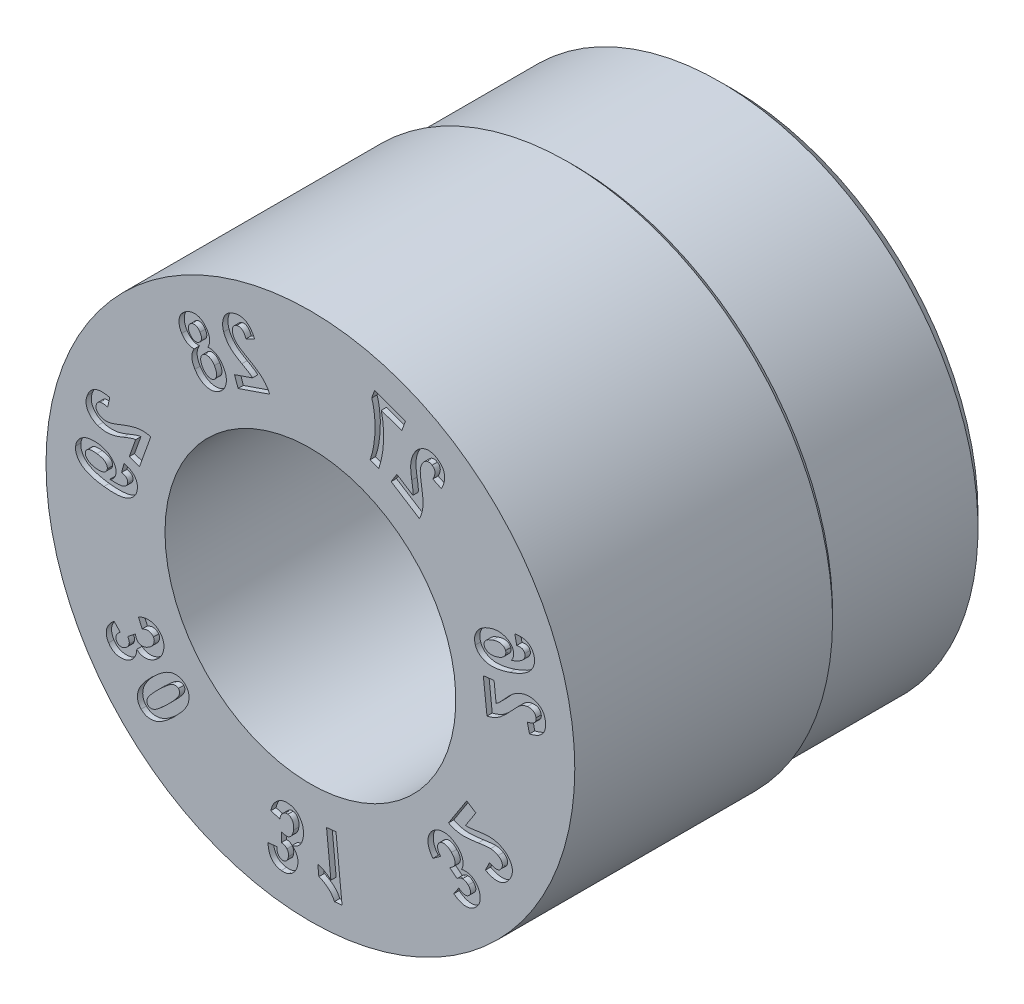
from build123d import *

# Parameters (mm, degrees)
CUT_EXTRUDE3_DEPTH = 0.2


with BuildPart() as part:
    # Sketch2 → Revolve1 (revolve)
    with BuildSketch(Plane(origin=(0, 0, 0), x_dir=(1, 0, 0), z_dir=(0, 1, 0)), mode=Mode.PRIVATE) as revolve1_sk:
        Polygon((9.249621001, 16), (2, 16), (2, 12), (5.5, 12), (5.5, 0), (10, 0), (10, 9.75), (9.75, 10), (9.75, 15.499621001), align=None)
    revolve(revolve1_sk.sketch.rotate(Axis((0, 0, -4.849143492), (0, 0, 1)), 180), axis=Axis((0, 0, -4.849143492), (0, 0, 1)))

    # Sketch9 → Cut-Extrude3 (cut)
    # profile 1 of 14: a face of its own
    with BuildSketch(Plane.XY):
        with BuildLine():
            Line((6.945865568, 1.365042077), (6.540235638, 1.320477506))
            Line((6.540235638, 1.320477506), (6.678180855, 0.065025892))
            add(Edge.make_bspline(
                [(6.678180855, 0.065025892), (6.715704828, 0.073454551), (6.790564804, 0.090269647), (6.898675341, 0.129366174), (7.003225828, 0.177097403), (7.087351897, 0.22610953), (7.154544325, 0.272765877), (7.209000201, 0.313824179), (7.266199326, 0.362047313), (7.327174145, 0.416399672), (7.390816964, 0.478076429), (7.458977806, 0.545092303), (7.529504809, 0.619702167), (7.577348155, 0.671840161), (7.602100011, 0.698813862)],
                knots=[0, 0, 0, 0, 1.210903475, 2.415741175, 3.614422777, 4.829304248, 5.477408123, 6.191639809, 6.977581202, 7.834306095, 8.765204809, 9.770030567, 10.846320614, 12, 12, 12, 12], degree=3))
            add(Edge.make_bspline(
                [(7.602100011, 0.698813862), (7.621493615, 0.719976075), (7.658507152, 0.760365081), (7.712090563, 0.817374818), (7.760531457, 0.86831873), (7.805043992, 0.912222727), (7.843539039, 0.950878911), (7.877680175, 0.982929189), (7.906968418, 1.008690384), (7.925657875, 1.022932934), (7.933981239, 1.029275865)],
                knots=[0, 0, 0, 0, 1.469359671, 2.804336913, 4.005076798, 5.067497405, 6.004650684, 6.797449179, 7.46444311, 8, 8, 8, 8], degree=3))
            add(Edge.make_bspline(
                [(7.933981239, 1.029275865), (7.955358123, 1.044197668), (7.997032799, 1.073288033), (8.064425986, 1.1061809), (8.132933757, 1.12967065), (8.179819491, 1.137046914), (8.202975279, 1.140689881)],
                knots=[0, 0, 0, 0, 1.061115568, 2.068666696, 3.046158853, 4, 4, 4, 4], degree=3))
            add(Edge.make_bspline(
                [(8.202975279, 1.140689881), (8.226488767, 1.142701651), (8.270832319, 1.146495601), (8.33392044, 1.140193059), (8.389204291, 1.125415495), (8.435969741, 1.100358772), (8.474169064, 1.067649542), (8.503006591, 1.027709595), (8.523161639, 0.981749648), (8.528419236, 0.948288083), (8.531121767, 0.931088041)],
                knots=[0, 0, 0, 0, 1.284830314, 2.42303217, 3.43989917, 4.386563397, 5.292301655, 6.158766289, 7.053562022, 8, 8, 8, 8], degree=3))
            add(Edge.make_bspline(
                [(8.531121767, 0.931088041), (8.532203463, 0.91222338), (8.534284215, 0.875935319), (8.523014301, 0.823182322), (8.498578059, 0.776618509), (8.462680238, 0.735711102), (8.414481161, 0.701237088), (8.354475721, 0.673642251), (8.283332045, 0.650090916), (8.231208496, 0.640471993), (8.203453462, 0.635350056)],
                knots=[0, 0, 0, 0, 0.913722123, 1.757635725, 2.579276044, 3.438933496, 4.37433614, 5.431505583, 6.632314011, 8, 8, 8, 8], degree=3))
            Line((8.203453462, 0.635350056), (8.286270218, 0.284828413))
            add(Edge.make_bspline(
                [(8.286270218, 0.284828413), (8.31395853, 0.290931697), (8.36773253, 0.302785), (8.444811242, 0.325419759), (8.515494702, 0.352114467), (8.580265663, 0.381350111), (8.638604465, 0.414314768), (8.690834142, 0.450457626), (8.736760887, 0.490310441), (8.776498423, 0.533492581), (8.810214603, 0.579832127), (8.838794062, 0.628761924), (8.861736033, 0.680576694), (8.878569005, 0.735325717), (8.891051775, 0.792508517), (8.897069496, 0.852635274), (8.897452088, 0.91555723), (8.893847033, 0.958166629), (8.891997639, 0.980025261)],
                knots=[0, 0, 0, 0, 1.316678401, 2.557146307, 3.727226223, 4.823655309, 5.854584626, 6.835260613, 7.768888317, 8.673026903, 9.554907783, 10.425565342, 11.300463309, 12.180346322, 13.081818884, 14.014614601, 14.981496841, 16, 16, 16, 16], degree=3))
            add(Edge.make_bspline(
                [(8.891997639, 0.980025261), (8.888757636, 1.003717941), (8.882472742, 1.049676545), (8.866609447, 1.115886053), (8.844542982, 1.176526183), (8.81757201, 1.232528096), (8.784348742, 1.28275039), (8.746072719, 1.328422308), (8.701630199, 1.368187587), (8.652545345, 1.402709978), (8.600390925, 1.432406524), (8.546377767, 1.45703509), (8.491167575, 1.476900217), (8.434879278, 1.492272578), (8.377263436, 1.50217599), (8.318487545, 1.508034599), (8.258453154, 1.508611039), (8.218218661, 1.50500781), (8.197940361, 1.503191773)],
                knots=[0, 0, 0, 0, 1.173652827, 2.276629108, 3.335023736, 4.336619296, 5.321091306, 6.283820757, 7.254537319, 8.239831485, 9.225125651, 10.197062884, 11.150738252, 12.103199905, 13.057936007, 14.017536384, 15.000832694, 16, 16, 16, 16], degree=3))
            add(Edge.make_bspline(
                [(8.197940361, 1.503191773), (8.174825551, 1.500196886), (8.128811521, 1.494235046), (8.061236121, 1.478908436), (7.995104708, 1.459528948), (7.93032393, 1.435803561), (7.866687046, 1.40666629), (7.803642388, 1.372641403), (7.7408576, 1.333355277), (7.68876188, 1.296518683), (7.646291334, 1.263324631), (7.61263581, 1.234079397), (7.576781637, 1.201608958), (7.539068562, 1.165425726), (7.499093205, 1.126320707), (7.457684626, 1.082975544), (7.413936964, 1.036467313), (7.384461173, 1.003853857), (7.369332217, 0.987114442)],
                knots=[0, 0, 0, 0, 1.116805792, 2.223195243, 3.31725657, 4.418851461, 5.527133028, 6.669491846, 7.850789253, 9.075422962, 9.72636706, 10.433968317, 11.212223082, 12.045064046, 12.93920453, 13.892729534, 14.918407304, 16, 16, 16, 16], degree=3))
            add(Edge.make_bspline(
                [(7.369332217, 0.987114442), (7.355318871, 0.971625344), (7.32862053, 0.94211539), (7.290381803, 0.900215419), (7.255349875, 0.863201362), (7.225242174, 0.829412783), (7.197406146, 0.801397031), (7.174401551, 0.776783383), (7.154368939, 0.757304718), (7.124551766, 0.728451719), (7.082959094, 0.692121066), (7.043022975, 0.666126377), (7.02383965, 0.653639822)],
                knots=[0, 0, 0, 0, 1.30077431, 2.478245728, 3.532467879, 4.474445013, 5.295791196, 5.991390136, 6.572169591, 7.035389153, 8.575948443, 10, 10, 10, 10], degree=3))
            Line((7.02383965, 0.653639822), (6.945865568, 1.365042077))
        make_face()
    # profile 2 of 14: a face of its own
    with BuildSketch(Plane.XY):
        with BuildLine():
            Line((7.73382222, 3.283731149), (7.801635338, 2.9378595))
            add(Edge.make_bspline(
                [(7.801635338, 2.9378595), (7.821582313, 2.942056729), (7.859158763, 2.949963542), (7.913435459, 2.954234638), (7.961692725, 2.951635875), (8.004201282, 2.941469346), (8.040975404, 2.923903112), (8.07146476, 2.898486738), (8.0957441, 2.865611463), (8.105805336, 2.839892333), (8.111051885, 2.826480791)],
                knots=[0, 0, 0, 0, 1.333591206, 2.512241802, 3.554141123, 4.485525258, 5.356408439, 6.197977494, 7.060314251, 8, 8, 8, 8], degree=3))
            add(Edge.make_bspline(
                [(8.111051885, 2.826480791), (8.113828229, 2.817289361), (8.119345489, 2.799023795), (8.122008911, 2.770717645), (8.121318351, 2.742407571), (8.115847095, 2.713959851), (8.106167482, 2.685497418), (8.092338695, 2.656918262), (8.074207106, 2.628535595), (8.052169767, 2.599109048), (8.023011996, 2.569709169), (7.985981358, 2.53977336), (7.940923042, 2.508711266), (7.887558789, 2.476540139), (7.825977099, 2.44359875), (7.755631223, 2.41047498), (7.677665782, 2.375012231), (7.622242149, 2.352494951), (7.593239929, 2.340712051)],
                knots=[0, 0, 0, 0, 0.592511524, 1.177461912, 1.749080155, 2.339419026, 2.961182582, 3.603851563, 4.297947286, 5.041581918, 5.873473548, 6.851091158, 7.983032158, 9.255776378, 10.703201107, 12.300391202, 14.064059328, 16, 16, 16, 16], degree=3))
            add(Edge.make_bspline(
                [(7.593239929, 2.340712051), (7.604142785, 2.356403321), (7.625260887, 2.38679626), (7.651771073, 2.434114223), (7.670528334, 2.481922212), (7.684054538, 2.529369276), (7.690396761, 2.576957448), (7.690305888, 2.624568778), (7.68454471, 2.672496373), (7.674913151, 2.703453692), (7.670033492, 2.719137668)],
                knots=[0, 0, 0, 0, 1.13820707, 2.204630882, 3.222381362, 4.191430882, 5.13771163, 6.07180751, 7.023115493, 8, 8, 8, 8], degree=3))
            add(Edge.make_bspline(
                [(7.670033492, 2.719137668), (7.663542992, 2.736111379), (7.650668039, 2.769781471), (7.624059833, 2.816605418), (7.5925124, 2.860062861), (7.554884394, 2.899225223), (7.51174885, 2.934732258), (7.463470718, 2.96688144), (7.409176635, 2.994430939), (7.35033481, 3.018383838), (7.287590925, 3.037920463), (7.221548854, 3.050349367), (7.153455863, 3.057033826), (7.082890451, 3.057693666), (7.010145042, 3.051552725), (6.935052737, 3.039280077), (6.857529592, 3.021534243), (6.805974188, 3.004732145), (6.779538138, 2.996116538)],
                knots=[0, 0, 0, 0, 0.841497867, 1.669246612, 2.48822592, 3.325730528, 4.179458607, 5.074245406, 6.00919843, 6.997071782, 8.017255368, 9.050224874, 10.106912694, 11.185890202, 12.317296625, 13.487094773, 14.711458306, 16, 16, 16, 16], degree=3))
            add(Edge.make_bspline(
                [(6.779538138, 2.996116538), (6.751794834, 2.986079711), (6.697830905, 2.966556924), (6.621079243, 2.932109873), (6.550881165, 2.89386289), (6.487158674, 2.8517235), (6.42973713, 2.806251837), (6.378344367, 2.757366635), (6.333673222, 2.704437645), (6.295564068, 2.648508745), (6.263742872, 2.590848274), (6.239986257, 2.531947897), (6.221561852, 2.4731597), (6.211202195, 2.413749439), (6.207347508, 2.35382934), (6.211412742, 2.293805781), (6.220800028, 2.233047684), (6.233266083, 2.193682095), (6.239614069, 2.173636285)],
                knots=[0, 0, 0, 0, 1.28476095, 2.499008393, 3.660368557, 4.763100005, 5.822459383, 6.846954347, 7.847372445, 8.833122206, 9.790834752, 10.709710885, 11.595209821, 12.469325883, 13.329980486, 14.203914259, 15.085394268, 16, 16, 16, 16], degree=3))
            add(Edge.make_bspline(
                [(6.239614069, 2.173636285), (6.247664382, 2.152052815), (6.263542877, 2.109481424), (6.297637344, 2.05085786), (6.338143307, 1.997497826), (6.385789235, 1.949797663), (6.440260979, 1.907879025), (6.501754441, 1.87168751), (6.570263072, 1.84137729), (6.645840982, 1.816204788), (6.72936493, 1.798606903), (6.821359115, 1.790284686), (6.921734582, 1.791216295), (7.030509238, 1.800944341), (7.147757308, 1.819258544), (7.273357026, 1.847724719), (7.407853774, 1.883873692), (7.499362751, 1.914212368), (7.54676617, 1.929928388)],
                knots=[0, 0, 0, 0, 0.744199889, 1.467865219, 2.184572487, 2.90691764, 3.642357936, 4.402718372, 5.209916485, 6.062013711, 6.975828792, 7.965088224, 9.04468978, 10.219402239, 11.495773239, 12.881284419, 14.384445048, 16, 16, 16, 16], degree=3))
            add(Edge.make_bspline(
                [(7.54676617, 1.929928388), (7.59463672, 1.946801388), (7.687025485, 1.979365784), (7.817831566, 2.033632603), (7.936432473, 2.089581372), (8.042677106, 2.147768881), (8.136404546, 2.208355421), (8.218425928, 2.270332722), (8.28762708, 2.335272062), (8.344282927, 2.402741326), (8.389920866, 2.471382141), (8.426874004, 2.540065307), (8.453258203, 2.609795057), (8.471172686, 2.67964787), (8.47949939, 2.750107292), (8.47844826, 2.821154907), (8.468247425, 2.892770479), (8.454001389, 2.93928758), (8.44679093, 2.962831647)],
                knots=[0, 0, 0, 0, 1.589652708, 3.067983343, 4.433649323, 5.695604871, 6.859266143, 7.92669892, 8.911578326, 9.825182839, 10.67979538, 11.489716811, 12.262756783, 13.009163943, 13.743392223, 14.477973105, 15.229644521, 16, 16, 16, 16], degree=3))
            add(Edge.make_bspline(
                [(8.44679093, 2.962831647), (8.44092504, 2.978752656), (8.429321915, 3.010245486), (8.407180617, 3.0547283), (8.381315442, 3.095727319), (8.352211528, 3.133660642), (8.319082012, 3.167844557), (8.28270802, 3.199040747), (8.242492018, 3.226233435), (8.199122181, 3.25044798), (8.152311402, 3.270848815), (8.101866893, 3.285975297), (8.048421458, 3.297033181), (7.991781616, 3.304012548), (7.931769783, 3.305723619), (7.868585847, 3.303125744), (7.802057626, 3.295968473), (7.757020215, 3.287891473), (7.73382222, 3.283731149)],
                knots=[0, 0, 0, 0, 0.942137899, 1.863612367, 2.754149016, 3.631912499, 4.514765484, 5.394088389, 6.289435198, 7.20696329, 8.150632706, 9.120005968, 10.12714648, 11.179873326, 12.28611005, 13.458547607, 14.690941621, 16, 16, 16, 16], degree=3))
        make_face()
        with BuildLine():
            add(Edge.make_bspline(
                [(7.088559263, 2.201745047), (7.071827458, 2.196129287), (7.039372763, 2.185236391), (6.990922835, 2.173531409), (6.944972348, 2.164141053), (6.901078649, 2.158469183), (6.859370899, 2.15590073), (6.819977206, 2.157462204), (6.782648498, 2.161458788), (6.747971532, 2.169897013), (6.715628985, 2.179887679), (6.686935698, 2.193191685), (6.66073633, 2.207213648), (6.638043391, 2.223670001), (6.61858869, 2.241983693), (6.601713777, 2.261747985), (6.588751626, 2.284003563), (6.582493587, 2.299908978), (6.579382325, 2.30781655)],
                knots=[0, 0, 0, 0, 1.475949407, 2.862900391, 4.166964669, 5.398359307, 6.563092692, 7.658261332, 8.693837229, 9.69779003, 10.63959194, 11.520864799, 12.339392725, 13.122689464, 13.857756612, 14.57102195, 15.289566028, 16, 16, 16, 16], degree=3))
            add(Edge.make_bspline(
                [(6.579382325, 2.30781655), (6.575015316, 2.323476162), (6.566402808, 2.354359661), (6.570529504, 2.403407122), (6.586386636, 2.451696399), (6.610029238, 2.490194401), (6.634986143, 2.52048108), (6.658935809, 2.542822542), (6.687171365, 2.564519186), (6.71956753, 2.585356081), (6.756298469, 2.605327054), (6.797176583, 2.6243297), (6.842141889, 2.643488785), (6.874076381, 2.654531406), (6.890701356, 2.660280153)],
                knots=[0, 0, 0, 0, 1.107892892, 2.184958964, 3.317218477, 4.572769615, 5.258842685, 6.006704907, 6.81463998, 7.70012255, 8.647391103, 9.681690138, 10.793096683, 12, 12, 12, 12], degree=3))
            add(Edge.make_bspline(
                [(6.890701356, 2.660280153), (6.907919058, 2.665970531), (6.941227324, 2.676978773), (6.990219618, 2.690215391), (7.036417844, 2.700314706), (7.079819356, 2.705916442), (7.12019765, 2.710099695), (7.157781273, 2.709451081), (7.192626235, 2.705920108), (7.233895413, 2.69665877), (7.279628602, 2.679624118), (7.325277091, 2.649214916), (7.360727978, 2.610232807), (7.374080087, 2.578751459), (7.380786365, 2.562939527)],
                knots=[0, 0, 0, 0, 1.174194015, 2.271520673, 3.285528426, 4.233681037, 5.10465996, 5.911519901, 6.663571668, 7.368730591, 8.647029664, 9.79859306, 10.894313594, 12, 12, 12, 12], degree=3))
            add(Edge.make_bspline(
                [(7.380786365, 2.562939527), (7.384939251, 2.546629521), (7.393175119, 2.514284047), (7.390620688, 2.462791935), (7.372934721, 2.412385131), (7.349512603, 2.37144979), (7.324219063, 2.339858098), (7.301515, 2.316078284), (7.274223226, 2.294620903), (7.24466048, 2.272844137), (7.210524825, 2.253644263), (7.173337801, 2.234708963), (7.132374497, 2.21711558), (7.10344631, 2.206967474), (7.088559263, 2.201745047)],
                knots=[0, 0, 0, 0, 1.167663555, 2.315672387, 3.527606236, 4.857989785, 5.58021247, 6.343114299, 7.141796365, 7.99474654, 8.898068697, 9.865059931, 10.901315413, 12, 12, 12, 12], degree=3))
        make_face(mode=Mode.SUBTRACT)
    # profile 3 of 14: a face of its own
    with BuildSketch(Plane.XY):
        with BuildLine():
            Line((3.272430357, 6.277623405), (3.053641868, 5.932770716))
            Line((3.053641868, 5.932770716), (4.121366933, 5.255035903))
            add(Edge.make_bspline(
                [(4.121366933, 5.255035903), (4.138155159, 5.28968839), (4.171623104, 5.358769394), (4.209046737, 5.467675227), (4.237208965, 5.579249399), (4.251765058, 5.675697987), (4.257259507, 5.757386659), (4.259322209, 5.825603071), (4.256949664, 5.900650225), (4.252983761, 5.98230446), (4.245137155, 6.070761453), (4.234790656, 6.165839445), (4.221166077, 6.267687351), (4.210199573, 6.337638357), (4.2045443, 6.373711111)],
                knots=[0, 0, 0, 0, 1.211062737, 2.41429795, 3.616663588, 4.829618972, 5.477921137, 6.19310041, 6.976746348, 7.840490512, 8.766075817, 9.771362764, 10.850722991, 12, 12, 12, 12], degree=3))
            add(Edge.make_bspline(
                [(4.2045443, 6.373711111), (4.200210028, 6.402150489), (4.191948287, 6.456359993), (4.180508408, 6.533773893), (4.171419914, 6.603583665), (4.163896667, 6.665599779), (4.159235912, 6.720186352), (4.155147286, 6.766856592), (4.153744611, 6.806028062), (4.153999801, 6.829466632), (4.15411371, 6.839928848)],
                knots=[0, 0, 0, 0, 1.470827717, 2.803607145, 4.000784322, 5.070147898, 5.99709853, 6.801656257, 7.46509832, 8, 8, 8, 8], degree=3))
            add(Edge.make_bspline(
                [(4.15411371, 6.839928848), (4.155980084, 6.866001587), (4.15961564, 6.916789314), (4.175385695, 6.990108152), (4.200183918, 7.058283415), (4.223718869, 7.099568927), (4.235411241, 7.120079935)],
                knots=[0, 0, 0, 0, 1.062376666, 2.069429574, 3.04087547, 4, 4, 4, 4], degree=3))
            add(Edge.make_bspline(
                [(4.235411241, 7.120079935), (4.248563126, 7.139701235), (4.273335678, 7.176659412), (4.31766026, 7.221875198), (4.363464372, 7.256032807), (4.41215971, 7.276814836), (4.461393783, 7.286025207), (4.510495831, 7.284419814), (4.558856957, 7.270792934), (4.588395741, 7.254174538), (4.603636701, 7.245600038)],
                knots=[0, 0, 0, 0, 1.287180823, 2.424500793, 3.439639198, 4.387442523, 5.28795894, 6.154144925, 7.047604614, 8, 8, 8, 8], degree=3))
            add(Edge.make_bspline(
                [(4.603636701, 7.245600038), (4.619116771, 7.234624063), (4.648834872, 7.213552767), (4.683038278, 7.171652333), (4.704489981, 7.123552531), (4.713438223, 7.069678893), (4.710402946, 7.010565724), (4.695274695, 6.946051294), (4.66868053, 6.875950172), (4.643769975, 6.829122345), (4.630546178, 6.804263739)],
                knots=[0, 0, 0, 0, 0.916038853, 1.758579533, 2.584042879, 3.439513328, 4.379183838, 5.432730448, 6.637161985, 8, 8, 8, 8], degree=3))
            Line((4.630546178, 6.804263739), (4.956552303, 6.649533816))
            add(Edge.make_bspline(
                [(4.956552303, 6.649533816), (4.969126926, 6.675008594), (4.993543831, 6.724474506), (5.023786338, 6.798993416), (5.047741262, 6.870660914), (5.065030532, 6.939671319), (5.075654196, 7.005848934), (5.080075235, 7.069357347), (5.078055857, 7.130249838), (5.068656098, 7.18838076), (5.053253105, 7.243679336), (5.033274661, 7.296898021), (5.006783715, 7.347121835), (4.975045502, 7.395083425), (4.937090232, 7.439832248), (4.894344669, 7.482810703), (4.845581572, 7.522720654), (4.809942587, 7.54643127), (4.791731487, 7.558547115)],
                knots=[0, 0, 0, 0, 1.316834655, 2.556977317, 3.725381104, 4.81786255, 5.851690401, 6.828967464, 7.765385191, 8.67000505, 9.551991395, 10.423387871, 11.300301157, 12.178859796, 13.084676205, 14.016095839, 14.986248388, 16, 16, 16, 16], degree=3))
            add(Edge.make_bspline(
                [(4.791731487, 7.558547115), (4.771261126, 7.570983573), (4.731519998, 7.595127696), (4.669556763, 7.62309387), (4.608412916, 7.644325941), (4.547738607, 7.65816031), (4.487495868, 7.663291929), (4.427977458, 7.662046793), (4.368942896, 7.652820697), (4.311247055, 7.635533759), (4.255792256, 7.61269406), (4.202652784, 7.586242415), (4.15240317, 7.556032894), (4.1052701, 7.521435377), (4.061136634, 7.482632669), (4.020313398, 7.43964096), (3.98227375, 7.392977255), (3.959797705, 7.359437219), (3.948433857, 7.342479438)],
                knots=[0, 0, 0, 0, 1.173167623, 2.27758597, 3.324660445, 4.342219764, 5.31890153, 6.281042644, 7.254146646, 8.237827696, 9.226332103, 10.190896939, 11.145125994, 12.096662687, 13.053064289, 14.021774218, 14.999812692, 16, 16, 16, 16], degree=3))
            add(Edge.make_bspline(
                [(3.948433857, 7.342479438), (3.936395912, 7.322538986), (3.912439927, 7.282856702), (3.881344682, 7.220872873), (3.855448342, 7.157013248), (3.833330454, 7.091546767), (3.816634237, 7.023527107), (3.803181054, 6.952904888), (3.795094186, 6.879157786), (3.791690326, 6.815380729), (3.791068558, 6.76143909), (3.79275912, 6.716839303), (3.795479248, 6.668523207), (3.799874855, 6.616491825), (3.806246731, 6.560804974), (3.813598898, 6.501191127), (3.823096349, 6.437899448), (3.829934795, 6.39447408), (3.833449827, 6.372152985)],
                knots=[0, 0, 0, 0, 1.115100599, 2.219094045, 3.316289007, 4.412781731, 5.524918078, 6.66741051, 7.853077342, 9.074334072, 9.72457179, 10.435557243, 11.211018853, 12.041831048, 12.935524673, 13.894892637, 14.917952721, 16, 16, 16, 16], degree=3))
            add(Edge.make_bspline(
                [(3.833449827, 6.372152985), (3.836843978, 6.351643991), (3.843326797, 6.312471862), (3.851458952, 6.256393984), (3.859334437, 6.206088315), (3.866131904, 6.161420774), (3.871147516, 6.122101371), (3.875174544, 6.088448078), (3.878840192, 6.060506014), (3.881873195, 6.018960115), (3.883912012, 5.963767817), (3.879471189, 5.916287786), (3.877350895, 5.893618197)],
                knots=[0, 0, 0, 0, 1.293559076, 2.470694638, 3.52597182, 4.462140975, 5.282131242, 5.992345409, 6.571484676, 7.035156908, 8.584420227, 10, 10, 10, 10], degree=3))
            Line((3.877350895, 5.893618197), (3.272430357, 6.277623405))
        make_face()
    # profile 4 of 14: a face of its own
    with BuildSketch(Plane.XY):
        with BuildLine():
            Line((3.457101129, 7.801665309), (3.595521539, 8.188643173))
            Line((3.595521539, 8.188643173), (2.427373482, 8.606842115))
            Line((2.427373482, 8.606842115), (2.319098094, 8.304626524))
            add(Edge.make_bspline(
                [(2.319098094, 8.304626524), (2.325885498, 8.285184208), (2.339910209, 8.245010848), (2.357996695, 8.18173048), (2.374360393, 8.113794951), (2.389063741, 8.041308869), (2.402820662, 7.964274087), (2.414874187, 7.882540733), (2.425407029, 7.796270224), (2.437552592, 7.675025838), (2.447275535, 7.518962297), (2.447703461, 7.328527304), (2.4386658, 7.135232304), (2.422215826, 6.973463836), (2.403998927, 6.844846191), (2.389406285, 6.750692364), (2.371575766, 6.659766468), (2.353849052, 6.571429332), (2.332715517, 6.486614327), (2.310439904, 6.404577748), (2.28713431, 6.325315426), (2.269100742, 6.274010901), (2.260207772, 6.248710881)],
                knots=[0, 0, 0, 0, 0.591390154, 1.221980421, 1.889339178, 2.598067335, 3.346051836, 4.136746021, 4.97071605, 5.842152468, 7.636452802, 9.459312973, 11.309233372, 13.192236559, 14.12697303, 15.040331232, 15.928372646, 16.788100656, 17.627830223, 18.438255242, 19.229850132, 20, 20, 20, 20], degree=3))
            Line((2.260207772, 6.248710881), (2.589067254, 6.131112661))
            add(Edge.make_bspline(
                [(2.589067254, 6.131112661), (2.601576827, 6.170151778), (2.626590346, 6.248212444), (2.658506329, 6.367298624), (2.686843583, 6.487579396), (2.711287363, 6.609210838), (2.731100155, 6.73216826), (2.74693495, 6.856550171), (2.758426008, 6.982442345), (2.76647841, 7.109218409), (2.770018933, 7.23596493), (2.769555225, 7.361532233), (2.764849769, 7.485384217), (2.756505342, 7.607547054), (2.744094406, 7.728144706), (2.726745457, 7.847008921), (2.706412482, 7.964375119), (2.688812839, 8.041456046), (2.680044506, 8.079858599)],
                knots=[0, 0, 0, 0, 0.996420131, 1.992391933, 2.996042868, 4.000089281, 5.007554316, 6.022967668, 7.047513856, 8.080130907, 9.110514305, 10.129224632, 11.132062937, 12.122896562, 13.105417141, 14.078308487, 15.042592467, 16, 16, 16, 16], degree=3))
            Line((2.680044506, 8.079858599), (3.457101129, 7.801665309))
        make_face()
    # profile 5 of 14: a face of its own
    with BuildSketch(Plane.XY):
        with BuildLine():
            Line((-2.86864015, 6.474133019), (-2.735520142, 6.087584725))
            Line((-2.735520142, 6.087584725), (-1.53864459, 6.498909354))
            add(Edge.make_bspline(
                [(-1.53864459, 6.498909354), (-1.555249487, 6.533729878), (-1.588292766, 6.603021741), (-1.649691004, 6.700522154), (-1.71922645, 6.792257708), (-1.785561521, 6.863775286), (-1.845559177, 6.919594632), (-1.898142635, 6.963319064), (-1.958077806, 7.008593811), (-2.024728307, 7.05632576), (-2.098746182, 7.105548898), (-2.179669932, 7.157012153), (-2.267679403, 7.210220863), (-2.329328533, 7.24531569), (-2.361151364, 7.263431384)],
                knots=[0, 0, 0, 0, 1.2119574, 2.411761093, 3.614693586, 4.826729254, 5.472819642, 6.190138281, 6.975628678, 7.833890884, 8.767117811, 9.769838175, 10.84880673, 12, 12, 12, 12], degree=3))
            add(Edge.make_bspline(
                [(-2.361151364, 7.263431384), (-2.386123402, 7.277706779), (-2.433794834, 7.3049584), (-2.501273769, 7.344677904), (-2.561639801, 7.381111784), (-2.615000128, 7.413733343), (-2.660794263, 7.443802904), (-2.699503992, 7.469900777), (-2.731338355, 7.492489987), (-2.749278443, 7.507491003), (-2.757323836, 7.514218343)],
                knots=[0, 0, 0, 0, 1.470835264, 2.807813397, 4.003711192, 5.076294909, 6.005567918, 6.80460163, 7.463912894, 8, 8, 8, 8], degree=3))
            add(Edge.make_bspline(
                [(-2.757323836, 7.514218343), (-2.776714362, 7.531806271), (-2.814610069, 7.566179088), (-2.861070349, 7.625291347), (-2.899641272, 7.686882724), (-2.91693518, 7.731141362), (-2.9255265, 7.753128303)],
                knots=[0, 0, 0, 0, 1.061324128, 2.074189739, 3.043290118, 4, 4, 4, 4], degree=3))
            add(Edge.make_bspline(
                [(-2.9255265, 7.753128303), (-2.932527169, 7.775706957), (-2.94570194, 7.818198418), (-2.954700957, 7.881142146), (-2.951673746, 7.938419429), (-2.937904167, 7.989611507), (-2.914201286, 8.03402165), (-2.882049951, 8.071267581), (-2.841092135, 8.100784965), (-2.80959049, 8.113354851), (-2.793248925, 8.119875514)],
                knots=[0, 0, 0, 0, 1.285688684, 2.419576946, 3.441336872, 4.387501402, 5.282251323, 6.158774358, 7.044859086, 8, 8, 8, 8], degree=3))
            add(Edge.make_bspline(
                [(-2.793248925, 8.119875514), (-2.774994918, 8.125134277), (-2.739912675, 8.135241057), (-2.685813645, 8.13532282), (-2.634741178, 8.122284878), (-2.587220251, 8.095335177), (-2.542721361, 8.056317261), (-2.502520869, 8.00373156), (-2.464062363, 7.939436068), (-2.443397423, 7.890523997), (-2.432404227, 7.864504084)],
                knots=[0, 0, 0, 0, 0.91627616, 1.760984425, 2.58464923, 3.441525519, 4.381534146, 5.431685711, 6.633725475, 8, 8, 8, 8], degree=3))
            Line((-2.432404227, 7.864504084), (-2.107604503, 8.023113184))
            add(Edge.make_bspline(
                [(-2.107604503, 8.023113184), (-2.119661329, 8.048978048), (-2.142976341, 8.098994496), (-2.182431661, 8.169085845), (-2.223498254, 8.232519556), (-2.266275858, 8.289429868), (-2.311605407, 8.339065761), (-2.35844222, 8.382149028), (-2.407512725, 8.418319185), (-2.45827387, 8.448077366), (-2.511194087, 8.470651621), (-2.565388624, 8.487858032), (-2.621154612, 8.498687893), (-2.678494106, 8.503207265), (-2.73723096, 8.502329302), (-2.797387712, 8.494589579), (-2.859238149, 8.482432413), (-2.900010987, 8.469164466), (-2.920872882, 8.462375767)],
                knots=[0, 0, 0, 0, 1.321705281, 2.555861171, 3.722754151, 4.820821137, 5.850063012, 6.832822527, 7.764359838, 8.669199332, 9.552350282, 10.424233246, 11.299152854, 12.177743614, 13.084828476, 14.015259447, 14.984484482, 16, 16, 16, 16], degree=3))
            add(Edge.make_bspline(
                [(-2.920872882, 8.462375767), (-2.943303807, 8.454044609), (-2.986932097, 8.437840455), (-3.047946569, 8.40749486), (-3.102538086, 8.372621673), (-3.151222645, 8.333837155), (-3.193128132, 8.290386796), (-3.22897431, 8.242839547), (-3.258229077, 8.190847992), (-3.28103686, 8.135184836), (-3.298050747, 8.077563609), (-3.310848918, 8.019467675), (-3.317568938, 7.961076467), (-3.321171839, 7.902691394), (-3.3173438, 7.844157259), (-3.310444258, 7.785304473), (-3.297307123, 7.726429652), (-3.28512633, 7.687750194), (-3.278981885, 7.668238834)],
                knots=[0, 0, 0, 0, 1.171635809, 2.278839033, 3.330648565, 4.339994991, 5.320843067, 6.279874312, 7.249415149, 8.234860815, 9.220189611, 10.189819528, 11.144910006, 12.097192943, 13.050805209, 14.013820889, 14.998097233, 16, 16, 16, 16], degree=3))
            add(Edge.make_bspline(
                [(-3.278981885, 7.668238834), (-3.270923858, 7.646344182), (-3.254895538, 7.602793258), (-3.225689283, 7.539703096), (-3.192162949, 7.479370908), (-3.154094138, 7.421593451), (-3.111696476, 7.365877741), (-3.064583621, 7.311447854), (-3.012074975, 7.258988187), (-2.964606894, 7.216030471), (-2.922543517, 7.182319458), (-2.887230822, 7.155104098), (-2.847664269, 7.127315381), (-2.804212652, 7.098167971), (-2.757138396, 7.067706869), (-2.705551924, 7.037238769), (-2.650886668, 7.004274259), (-2.612528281, 6.982865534), (-2.592758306, 6.971831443)],
                knots=[0, 0, 0, 0, 1.116400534, 2.22064614, 3.323820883, 4.417360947, 5.529617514, 6.672972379, 7.860246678, 9.080470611, 9.735123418, 10.440075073, 11.214159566, 12.048862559, 12.944623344, 13.897479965, 14.916357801, 16, 16, 16, 16], degree=3))
            add(Edge.make_bspline(
                [(-2.592758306, 6.971831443), (-2.57447565, 6.961559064), (-2.539717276, 6.942029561), (-2.490419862, 6.913620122), (-2.446212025, 6.888020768), (-2.407148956, 6.865018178), (-2.373075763, 6.844879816), (-2.34404615, 6.82760255), (-2.32039473, 6.812366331), (-2.285808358, 6.789107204), (-2.241380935, 6.756019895), (-2.206910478, 6.722920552), (-2.190366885, 6.707035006)],
                knots=[0, 0, 0, 0, 1.301863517, 2.475059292, 3.532167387, 4.473213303, 5.289274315, 5.989332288, 6.570207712, 7.035468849, 8.577216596, 10, 10, 10, 10], degree=3))
            Line((-2.190366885, 6.707035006), (-2.86864015, 6.474133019))
        make_face()
    # profile 6 of 14: a face of its own
    with BuildSketch(Plane.XY):
        with BuildLine():
            add(Edge.make_bspline(
                [(-3.879916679, 6.872441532), (-3.868226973, 6.893802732), (-3.845353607, 6.935600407), (-3.821935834, 7.002228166), (-3.808801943, 7.069826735), (-3.806234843, 7.138477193), (-3.814806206, 7.207817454), (-3.833083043, 7.27787178), (-3.862145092, 7.348516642), (-3.888151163, 7.393813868), (-3.901574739, 7.417194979)],
                knots=[0, 0, 0, 0, 1.012780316, 1.981717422, 2.927157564, 3.871033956, 4.829999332, 5.826418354, 6.878060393, 8, 8, 8, 8], degree=3))
            add(Edge.make_bspline(
                [(-3.901574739, 7.417194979), (-3.913576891, 7.435710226), (-3.93704134, 7.471907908), (-3.976074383, 7.521802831), (-4.017396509, 7.56644846), (-4.061449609, 7.60510261), (-4.107214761, 7.638967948), (-4.155577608, 7.666965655), (-4.206217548, 7.689419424), (-4.2589165, 7.705925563), (-4.312694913, 7.716981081), (-4.367127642, 7.722043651), (-4.421751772, 7.7205205), (-4.476600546, 7.713647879), (-4.531690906, 7.700629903), (-4.586843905, 7.681247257), (-4.641973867, 7.655692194), (-4.677634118, 7.634887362), (-4.695861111, 7.624253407)],
                knots=[0, 0, 0, 0, 1.141258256, 2.231182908, 3.27338455, 4.284266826, 5.259309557, 6.214719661, 7.169692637, 8.11970871, 9.066575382, 10.005710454, 10.941556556, 11.888524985, 12.861358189, 13.864618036, 14.908544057, 16, 16, 16, 16], degree=3))
            add(Edge.make_bspline(
                [(-4.695861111, 7.624253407), (-4.71470015, 7.612108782), (-4.751262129, 7.588539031), (-4.800798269, 7.548491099), (-4.843695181, 7.505890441), (-4.880602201, 7.461036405), (-4.911363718, 7.413864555), (-4.935490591, 7.363941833), (-4.952891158, 7.311566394), (-4.963917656, 7.257212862), (-4.969318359, 7.202072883), (-4.969861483, 7.146869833), (-4.965849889, 7.091994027), (-4.956037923, 7.037599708), (-4.941416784, 6.98371743), (-4.921543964, 6.93032567), (-4.896929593, 6.877178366), (-4.876784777, 6.843028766), (-4.866564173, 6.825702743)],
                knots=[0, 0, 0, 0, 1.167406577, 2.265651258, 3.312192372, 4.31290498, 5.287192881, 6.239806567, 7.194128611, 8.155524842, 9.123909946, 10.076933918, 11.029342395, 11.986663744, 12.952623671, 13.934936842, 14.95227667, 16, 16, 16, 16], degree=3))
            add(Edge.make_bspline(
                [(-4.866564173, 6.825702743), (-4.851518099, 6.803147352), (-4.822273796, 6.759307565), (-4.771603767, 6.70081736), (-4.715402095, 6.652821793), (-4.655865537, 6.61368026), (-4.593123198, 6.584220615), (-4.528442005, 6.563937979), (-4.461530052, 6.553818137), (-4.416637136, 6.554858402), (-4.393958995, 6.555383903)],
                knots=[0, 0, 0, 0, 1.134915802, 2.205879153, 3.228599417, 4.22082498, 5.181303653, 6.121969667, 7.051292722, 8, 8, 8, 8], degree=3))
            add(Edge.make_bspline(
                [(-4.393958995, 6.555383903), (-4.408683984, 6.530188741), (-4.437431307, 6.481000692), (-4.466420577, 6.401834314), (-4.482891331, 6.321589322), (-4.485959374, 6.239763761), (-4.475947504, 6.156697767), (-4.453947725, 6.071883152), (-4.417839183, 5.986016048), (-4.385848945, 5.930601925), (-4.369298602, 5.901933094)],
                knots=[0, 0, 0, 0, 1.008177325, 1.968245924, 2.901856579, 3.832508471, 4.788393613, 5.787252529, 6.855221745, 8, 8, 8, 8], degree=3))
            add(Edge.make_bspline(
                [(-4.369298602, 5.901933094), (-4.350337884, 5.873144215), (-4.313311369, 5.816925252), (-4.249606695, 5.741135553), (-4.179674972, 5.676734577), (-4.10585758, 5.622565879), (-4.028528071, 5.579983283), (-3.949545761, 5.548364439), (-3.868383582, 5.530542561), (-3.786738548, 5.52408764), (-3.705353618, 5.529901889), (-3.625406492, 5.546610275), (-3.54760737, 5.575869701), (-3.498966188, 5.603179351), (-3.474244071, 5.617059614)],
                knots=[0, 0, 0, 0, 1.177482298, 2.299388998, 3.373400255, 4.419494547, 5.42070493, 6.383096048, 7.316514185, 8.249451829, 9.172772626, 10.095425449, 11.031990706, 12, 12, 12, 12], degree=3))
            add(Edge.make_bspline(
                [(-3.474244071, 5.617059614), (-3.455551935, 5.629287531), (-3.418978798, 5.653212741), (-3.368734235, 5.694142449), (-3.324874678, 5.739175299), (-3.286333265, 5.787580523), (-3.252927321, 5.838896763), (-3.225611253, 5.894283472), (-3.204595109, 5.953185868), (-3.188512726, 6.014840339), (-3.178491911, 6.078437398), (-3.176590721, 6.143266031), (-3.180686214, 6.20850038), (-3.191598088, 6.274444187), (-3.209914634, 6.340732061), (-3.23498493, 6.407674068), (-3.26644911, 6.475368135), (-3.292384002, 6.51914377), (-3.305660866, 6.541553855)],
                knots=[0, 0, 0, 0, 1.014452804, 1.984884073, 2.93754273, 3.865121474, 4.792353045, 5.714361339, 6.664155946, 7.629084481, 8.606154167, 9.582387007, 10.569769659, 11.572064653, 12.613621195, 13.689311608, 14.817088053, 16, 16, 16, 16], degree=3))
            add(Edge.make_bspline(
                [(-3.305660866, 6.541553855), (-3.323980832, 6.569452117), (-3.359481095, 6.623513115), (-3.421954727, 6.694532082), (-3.488427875, 6.75481313), (-3.559983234, 6.803079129), (-3.63578232, 6.839197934), (-3.714666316, 6.863312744), (-3.79672189, 6.875360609), (-3.851901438, 6.87342451), (-3.879916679, 6.872441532)],
                knots=[0, 0, 0, 0, 1.144414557, 2.217636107, 3.236539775, 4.217173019, 5.169121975, 6.10789893, 7.039360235, 8, 8, 8, 8], degree=3))
        make_face()
        with BuildLine():
            add(Edge.make_bspline(
                [(-4.175881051, 7.211439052), (-4.1652441, 7.193013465), (-4.145111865, 7.158139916), (-4.126278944, 7.103534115), (-4.116648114, 7.051632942), (-4.119368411, 7.002251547), (-4.132069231, 6.957247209), (-4.153214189, 6.917160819), (-4.182828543, 6.88231115), (-4.207909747, 6.86478641), (-4.220786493, 6.855789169)],
                knots=[0, 0, 0, 0, 1.263902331, 2.392149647, 3.421343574, 4.387637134, 5.308185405, 6.184434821, 7.067884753, 8, 8, 8, 8], degree=3))
            add(Edge.make_bspline(
                [(-4.220786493, 6.855789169), (-4.234593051, 6.848183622), (-4.26172095, 6.833239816), (-4.306556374, 6.822291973), (-4.352363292, 6.821071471), (-4.398478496, 6.830378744), (-4.443984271, 6.850229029), (-4.48694305, 6.881203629), (-4.526560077, 6.923356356), (-4.548849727, 6.956764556), (-4.560631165, 6.974422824)],
                knots=[0, 0, 0, 0, 0.930642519, 1.828578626, 2.703181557, 3.627284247, 4.592537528, 5.623164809, 6.743697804, 8, 8, 8, 8], degree=3))
            add(Edge.make_bspline(
                [(-4.560631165, 6.974422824), (-4.570768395, 6.992324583), (-4.590040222, 7.02635751), (-4.608912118, 7.079394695), (-4.616922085, 7.130727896), (-4.614380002, 7.179491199), (-4.602326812, 7.224523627), (-4.581855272, 7.264707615), (-4.552308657, 7.298982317), (-4.527684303, 7.316263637), (-4.515117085, 7.325083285)],
                knots=[0, 0, 0, 0, 1.242944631, 2.362954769, 3.38477091, 4.3667065, 5.294805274, 6.185091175, 7.073748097, 8, 8, 8, 8], degree=3))
            add(Edge.make_bspline(
                [(-4.515117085, 7.325083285), (-4.500898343, 7.332838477), (-4.473329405, 7.34787514), (-4.42776565, 7.359080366), (-4.381594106, 7.360236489), (-4.335137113, 7.350918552), (-4.290082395, 7.331226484), (-4.247737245, 7.300995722), (-4.20875586, 7.260681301), (-4.187170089, 7.228348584), (-4.175881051, 7.211439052)],
                knots=[0, 0, 0, 0, 0.963484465, 1.868114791, 2.769905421, 3.700897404, 4.673346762, 5.682850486, 6.7881651, 8, 8, 8, 8], degree=3))
        make_face(mode=Mode.SUBTRACT)
        with BuildLine():
            add(Edge.make_bspline(
                [(-3.630721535, 6.389981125), (-3.623053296, 6.377092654), (-3.608191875, 6.352114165), (-3.589043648, 6.314165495), (-3.573372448, 6.277264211), (-3.560925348, 6.241325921), (-3.552528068, 6.206128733), (-3.547279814, 6.171910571), (-3.54576702, 6.13861533), (-3.547689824, 6.096849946), (-3.55729649, 6.048304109), (-3.579897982, 5.996919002), (-3.611719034, 5.952858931), (-3.640617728, 5.932371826), (-3.655178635, 5.922049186)],
                knots=[0, 0, 0, 0, 1.034718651, 2.005335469, 2.930569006, 3.799833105, 4.626516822, 5.424291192, 6.185341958, 6.922289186, 8.307007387, 9.569983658, 10.775611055, 12, 12, 12, 12], degree=3))
            add(Edge.make_bspline(
                [(-3.655178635, 5.922049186), (-3.670786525, 5.91358436), (-3.701618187, 5.896863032), (-3.754134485, 5.887417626), (-3.808348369, 5.890504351), (-3.854093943, 5.902876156), (-3.890805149, 5.9194582), (-3.918973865, 5.935613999), (-3.94640507, 5.956051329), (-3.973712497, 5.979670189), (-4.000418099, 6.00720375), (-4.026186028, 6.038936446), (-4.052473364, 6.073613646), (-4.068465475, 6.098960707), (-4.076691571, 6.111998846)],
                knots=[0, 0, 0, 0, 1.230068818, 2.42986499, 3.656712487, 4.989682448, 5.702453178, 6.45887434, 7.2463549, 8.08104659, 8.971532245, 9.913590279, 10.926782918, 12, 12, 12, 12], degree=3))
            add(Edge.make_bspline(
                [(-4.076691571, 6.111998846), (-4.0895392, 6.134640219), (-4.114028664, 6.177797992), (-4.138976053, 6.244915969), (-4.15110938, 6.310092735), (-4.149933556, 6.372143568), (-4.138609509, 6.429338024), (-4.115551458, 6.479260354), (-4.082919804, 6.522144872), (-4.053944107, 6.542660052), (-4.039221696, 6.553083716)],
                knots=[0, 0, 0, 0, 1.265062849, 2.411395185, 3.46647437, 4.47092224, 5.414162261, 6.281358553, 7.126766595, 8, 8, 8, 8], degree=3))
            add(Edge.make_bspline(
                [(-4.039221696, 6.553083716), (-4.023462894, 6.561476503), (-3.992415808, 6.57801149), (-3.939608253, 6.587339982), (-3.884700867, 6.585301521), (-3.828381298, 6.569776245), (-3.77262163, 6.542757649), (-3.72011509, 6.50319762), (-3.671801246, 6.451752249), (-3.644822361, 6.411184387), (-3.630721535, 6.389981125)],
                knots=[0, 0, 0, 0, 0.870722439, 1.715447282, 2.59237604, 3.547286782, 4.557623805, 5.614076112, 6.752969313, 8, 8, 8, 8], degree=3))
        make_face(mode=Mode.SUBTRACT)
    # profile 7 of 14: a face of its own
    with BuildSketch(Plane.XY):
        with BuildLine():
            Line((-6.851449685, 1.797298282), (-6.465039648, 1.659151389))
            Line((-6.465039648, 1.659151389), (-6.037443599, 2.855040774))
            add(Edge.make_bspline(
                [(-6.037443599, 2.855040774), (-6.07510062, 2.863905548), (-6.150219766, 2.881589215), (-6.265213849, 2.894157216), (-6.380815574, 2.896956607), (-6.478514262, 2.890319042), (-6.559816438, 2.877369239), (-6.627042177, 2.864086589), (-6.700254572, 2.845984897), (-6.779098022, 2.822896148), (-6.864235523, 2.796230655), (-6.955008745, 2.764922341), (-7.051714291, 2.728884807), (-7.117920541, 2.702884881), (-7.152203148, 2.689421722)],
                knots=[0, 0, 0, 0, 1.211020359, 2.415773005, 3.615550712, 4.830725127, 5.476726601, 6.19373444, 6.976949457, 7.838438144, 8.767117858, 9.77170595, 10.84615529, 12, 12, 12, 12], degree=3))
            add(Edge.make_bspline(
                [(-7.152203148, 2.689421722), (-7.178983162, 2.678876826), (-7.230164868, 2.658723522), (-7.303457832, 2.63048331), (-7.369826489, 2.605968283), (-7.428979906, 2.584795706), (-7.481060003, 2.567015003), (-7.526176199, 2.55378282), (-7.563943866, 2.54328362), (-7.586911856, 2.538489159), (-7.597168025, 2.536348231)],
                knots=[0, 0, 0, 0, 1.46638576, 2.802542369, 4.001747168, 5.070975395, 6.003722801, 6.804857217, 7.466318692, 8, 8, 8, 8], degree=3))
            add(Edge.make_bspline(
                [(-7.597168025, 2.536348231), (-7.623169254, 2.532139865), (-7.673854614, 2.523936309), (-7.749442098, 2.523707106), (-7.821981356, 2.532279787), (-7.86759013, 2.54664898), (-7.890195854, 2.553770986)],
                knots=[0, 0, 0, 0, 1.062732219, 2.071631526, 3.044215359, 4, 4, 4, 4], degree=3))
            add(Edge.make_bspline(
                [(-7.890195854, 2.553770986), (-7.91237426, 2.56232043), (-7.954130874, 2.578416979), (-8.008403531, 2.61187136), (-8.051995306, 2.649417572), (-8.083104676, 2.692493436), (-8.10305908, 2.73869529), (-8.112043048, 2.787119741), (-8.109656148, 2.837653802), (-8.099868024, 2.87030569), (-8.094799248, 2.887214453)],
                knots=[0, 0, 0, 0, 1.288024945, 2.425041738, 3.443479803, 4.392021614, 5.28348595, 6.154607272, 7.044364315, 8, 8, 8, 8], degree=3))
            add(Edge.make_bspline(
                [(-8.094799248, 2.887214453), (-8.087388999, 2.904751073), (-8.073141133, 2.938469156), (-8.039606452, 2.981096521), (-7.997454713, 3.013031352), (-7.946550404, 3.033539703), (-7.887815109, 3.043755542), (-7.821213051, 3.042311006), (-7.746663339, 3.032335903), (-7.695478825, 3.017984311), (-7.668290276, 3.010360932)],
                knots=[0, 0, 0, 0, 0.915179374, 1.759637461, 2.582396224, 3.438150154, 4.381506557, 5.438748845, 6.639496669, 8, 8, 8, 8], degree=3))
            Line((-7.668290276, 3.010360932), (-7.588976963, 3.364434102))
            add(Edge.make_bspline(
                [(-7.588976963, 3.364434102), (-7.616721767, 3.371177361), (-7.670577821, 3.384266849), (-7.750353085, 3.396654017), (-7.825818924, 3.404753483), (-7.897232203, 3.406581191), (-7.964610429, 3.402796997), (-8.027739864, 3.39245365), (-8.08681869, 3.376664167), (-8.141875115, 3.355294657), (-8.192855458, 3.328154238), (-8.240168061, 3.296220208), (-8.283603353, 3.259261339), (-8.323239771, 3.217405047), (-8.358806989, 3.170512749), (-8.391353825, 3.119085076), (-8.41949926, 3.062408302), (-8.434968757, 3.022252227), (-8.442843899, 3.001809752)],
                knots=[0, 0, 0, 0, 1.317628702, 2.557678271, 3.723917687, 4.819640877, 5.85199432, 6.834863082, 7.767595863, 8.670575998, 9.555131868, 10.428458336, 11.300906, 12.182856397, 13.084362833, 14.013937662, 14.988944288, 16, 16, 16, 16], degree=3))
            add(Edge.make_bspline(
                [(-8.442843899, 3.001809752), (-8.450452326, 2.978982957), (-8.465228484, 2.934651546), (-8.479362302, 2.867787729), (-8.486288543, 2.803242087), (-8.486272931, 2.740862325), (-8.478384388, 2.680798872), (-8.464205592, 2.622771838), (-8.441873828, 2.567184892), (-8.412228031, 2.514700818), (-8.377670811, 2.465301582), (-8.340299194, 2.418624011), (-8.298645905, 2.376590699), (-8.254488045, 2.337822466), (-8.206890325, 2.303149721), (-8.15599255, 2.272727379), (-8.10222691, 2.245128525), (-8.064196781, 2.230777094), (-8.044886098, 2.223489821)],
                knots=[0, 0, 0, 0, 1.173947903, 2.279898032, 3.328601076, 4.338469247, 5.317369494, 6.27926869, 7.247330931, 8.231707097, 9.215385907, 10.188279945, 11.146963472, 12.100263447, 13.05455268, 14.017046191, 14.993109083, 16, 16, 16, 16], degree=3))
            add(Edge.make_bspline(
                [(-8.044886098, 2.223489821), (-8.022587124, 2.216035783), (-7.978265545, 2.201220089), (-7.910362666, 2.185310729), (-7.842225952, 2.173165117), (-7.773167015, 2.167238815), (-7.702840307, 2.165121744), (-7.630783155, 2.168394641), (-7.556604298, 2.175546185), (-7.493408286, 2.186643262), (-7.440395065, 2.197943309), (-7.397060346, 2.209140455), (-7.350259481, 2.222171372), (-7.30044003, 2.238819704), (-7.247123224, 2.257054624), (-7.190287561, 2.277020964), (-7.130639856, 2.300571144), (-7.089742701, 2.316899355), (-7.068686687, 2.32530598)],
                knots=[0, 0, 0, 0, 1.120498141, 2.227109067, 3.321825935, 4.417738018, 5.528653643, 6.674376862, 7.854643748, 9.079543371, 9.731237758, 10.438793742, 11.213262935, 12.047085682, 12.942696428, 13.900266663, 14.918946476, 16, 16, 16, 16], degree=3))
            add(Edge.make_bspline(
                [(-7.068686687, 2.32530598), (-7.049322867, 2.333083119), (-7.012200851, 2.347992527), (-6.959200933, 2.369361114), (-6.911055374, 2.387356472), (-6.868756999, 2.404169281), (-6.831509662, 2.418122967), (-6.799537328, 2.429636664), (-6.772725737, 2.438515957), (-6.733203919, 2.451984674), (-6.679292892, 2.465308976), (-6.631888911, 2.471785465), (-6.609170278, 2.47488936)],
                knots=[0, 0, 0, 0, 1.291358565, 2.475639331, 3.536183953, 4.471900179, 5.292297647, 5.997541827, 6.57467296, 7.040045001, 8.581424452, 10, 10, 10, 10], degree=3))
            Line((-6.609170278, 2.47488936), (-6.851449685, 1.797298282))
        make_face()
    # profile 8 of 14: a face of its own
    with BuildSketch(Plane.XY):
        with BuildLine():
            Line((-7.049154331, 1.478429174), (-7.138129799, 1.13711538))
            add(Edge.make_bspline(
                [(-7.138129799, 1.13711538), (-7.118573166, 1.132225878), (-7.081723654, 1.123012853), (-7.031563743, 1.103417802), (-6.989448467, 1.080356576), (-6.955845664, 1.052828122), (-6.930600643, 1.021242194), (-6.914231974, 0.98550887), (-6.907059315, 0.945767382), (-6.908854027, 0.918521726), (-6.909785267, 0.904384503)],
                knots=[0, 0, 0, 0, 1.331551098, 2.508970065, 3.54987745, 4.493345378, 5.361813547, 6.19980391, 7.065914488, 8, 8, 8, 8], degree=3))
            add(Edge.make_bspline(
                [(-6.909785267, 0.904384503), (-6.911230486, 0.894529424), (-6.914057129, 0.875254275), (-6.924314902, 0.847989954), (-6.937198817, 0.822274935), (-6.954386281, 0.798509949), (-6.975351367, 0.77671467), (-7.000172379, 0.756912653), (-7.028808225, 0.739109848), (-7.061726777, 0.722890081), (-7.100455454, 0.70856489), (-7.146679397, 0.697851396), (-7.200596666, 0.690279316), (-7.2622098, 0.683616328), (-7.331923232, 0.681574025), (-7.409418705, 0.681183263), (-7.494888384, 0.683920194), (-7.554389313, 0.687476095), (-7.585563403, 0.689339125)],
                knots=[0, 0, 0, 0, 0.613782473, 1.200472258, 1.790199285, 2.387413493, 3.00476796, 3.653738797, 4.344227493, 5.084471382, 5.918086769, 6.889929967, 8.009815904, 9.281444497, 10.717195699, 12.316696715, 14.070221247, 16, 16, 16, 16], degree=3))
            add(Edge.make_bspline(
                [(-7.585563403, 0.689339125), (-7.569257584, 0.698780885), (-7.537536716, 0.717148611), (-7.493585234, 0.748424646), (-7.456210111, 0.783857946), (-7.423832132, 0.821601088), (-7.397155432, 0.862426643), (-7.376117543, 0.906256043), (-7.360737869, 0.953380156), (-7.355678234, 0.986256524), (-7.353101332, 1.003000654)],
                knots=[0, 0, 0, 0, 1.111221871, 2.16173881, 3.172940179, 4.141339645, 5.089088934, 6.040574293, 7.002052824, 8, 8, 8, 8], degree=3))
            add(Edge.make_bspline(
                [(-7.353101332, 1.003000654), (-7.351598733, 1.020610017), (-7.348615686, 1.055569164), (-7.352284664, 1.108071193), (-7.361901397, 1.159841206), (-7.378814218, 1.210698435), (-7.402197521, 1.260806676), (-7.431513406, 1.310377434), (-7.467867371, 1.35889001), (-7.510407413, 1.40586556), (-7.557983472, 1.451065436), (-7.611770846, 1.490908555), (-7.669474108, 1.527322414), (-7.732630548, 1.558116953), (-7.800360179, 1.584555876), (-7.872908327, 1.606307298), (-7.95019028, 1.623787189), (-8.003695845, 1.631376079), (-8.031113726, 1.635264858)],
                knots=[0, 0, 0, 0, 0.824652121, 1.637148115, 2.449901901, 3.279145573, 4.133584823, 5.029114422, 5.96499381, 6.960554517, 7.987499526, 9.025174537, 10.082498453, 11.171230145, 12.302241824, 13.476040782, 14.706646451, 16, 16, 16, 16], degree=3))
            add(Edge.make_bspline(
                [(-8.031113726, 1.635264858), (-8.060425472, 1.638349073), (-8.117515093, 1.64435611), (-8.201676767, 1.646584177), (-8.281742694, 1.64270133), (-8.35774726, 1.632944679), (-8.429636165, 1.617423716), (-8.497179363, 1.595321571), (-8.560588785, 1.567263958), (-8.61954435, 1.533908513), (-8.673103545, 1.495485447), (-8.721129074, 1.453621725), (-8.763577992, 1.408627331), (-8.798505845, 1.359268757), (-8.828900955, 1.307697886), (-8.851437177, 1.251914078), (-8.868833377, 1.193293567), (-8.875181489, 1.152635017), (-8.878393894, 1.132060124)],
                knots=[0, 0, 0, 0, 1.282367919, 2.497630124, 3.659906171, 4.767811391, 5.829037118, 6.855896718, 7.855121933, 8.842151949, 9.798571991, 10.718664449, 11.611788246, 12.483069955, 13.34517533, 14.210857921, 15.094620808, 16, 16, 16, 16], degree=3))
            add(Edge.make_bspline(
                [(-8.878393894, 1.132060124), (-8.880581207, 1.108817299), (-8.884878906, 1.063149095), (-8.879280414, 0.995078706), (-8.866858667, 0.928959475), (-8.844254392, 0.865250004), (-8.813918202, 0.803281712), (-8.773825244, 0.744170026), (-8.726206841, 0.686340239), (-8.66895342, 0.631127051), (-8.601327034, 0.579275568), (-8.522519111, 0.531232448), (-8.431779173, 0.488696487), (-8.329751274, 0.449790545), (-8.215817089, 0.416370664), (-8.090708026, 0.38602555), (-7.953800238, 0.36078262), (-7.858421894, 0.34796525), (-7.808878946, 0.341307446)],
                knots=[0, 0, 0, 0, 0.753315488, 1.48013704, 2.199189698, 2.922778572, 3.658173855, 4.423787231, 5.225991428, 6.076264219, 6.988889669, 7.97553614, 9.053798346, 10.223927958, 11.502209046, 12.889274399, 14.384177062, 16, 16, 16, 16], degree=3))
            add(Edge.make_bspline(
                [(-7.808878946, 0.341307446), (-7.758356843, 0.335517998), (-7.660833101, 0.32434252), (-7.519166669, 0.316563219), (-7.387711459, 0.315162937), (-7.266509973, 0.320619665), (-7.155556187, 0.334993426), (-7.054725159, 0.355245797), (-6.964013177, 0.383421), (-6.883518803, 0.419338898), (-6.812473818, 0.461333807), (-6.749619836, 0.507744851), (-6.69469587, 0.558662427), (-6.647946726, 0.614350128), (-6.609440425, 0.674951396), (-6.579947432, 0.740446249), (-6.557803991, 0.810254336), (-6.550102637, 0.85889786), (-6.546190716, 0.883606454)],
                knots=[0, 0, 0, 0, 1.586164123, 3.061801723, 4.423733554, 5.68640877, 6.843126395, 7.910811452, 8.891252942, 9.799938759, 10.654211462, 11.461038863, 12.233080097, 12.98518869, 13.723272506, 14.465394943, 15.22049373, 16, 16, 16, 16], degree=3))
            add(Edge.make_bspline(
                [(-6.546190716, 0.883606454), (-6.544452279, 0.900794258), (-6.541022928, 0.934699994), (-6.541467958, 0.985033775), (-6.546606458, 1.033673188), (-6.556694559, 1.080358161), (-6.570862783, 1.125451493), (-6.589979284, 1.168727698), (-6.613846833, 1.210263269), (-6.642334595, 1.250070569), (-6.675705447, 1.287548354), (-6.713916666, 1.322897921), (-6.757603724, 1.354981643), (-6.806258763, 1.384839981), (-6.859469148, 1.412573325), (-6.918304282, 1.436949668), (-6.981691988, 1.459671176), (-7.026296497, 1.472073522), (-7.049154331, 1.478429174)],
                knots=[0, 0, 0, 0, 0.960050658, 1.893855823, 2.793098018, 3.67522371, 4.545325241, 5.417087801, 6.300390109, 7.204732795, 8.134078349, 9.086136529, 10.093878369, 11.142601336, 12.258199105, 13.426452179, 14.681170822, 16, 16, 16, 16], degree=3))
        make_face()
        with BuildLine():
            add(Edge.make_bspline(
                [(-8.102586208, 0.784311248), (-8.119856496, 0.786689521), (-8.153411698, 0.791310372), (-8.202051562, 0.800840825), (-8.247073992, 0.813285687), (-8.289043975, 0.826735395), (-8.327381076, 0.842885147), (-8.362006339, 0.861954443), (-8.394094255, 0.88184788), (-8.421778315, 0.904838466), (-8.445949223, 0.928603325), (-8.467069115, 0.952525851), (-8.484578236, 0.976723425), (-8.497761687, 1.001697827), (-8.508151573, 1.026412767), (-8.513822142, 1.05192045), (-8.516287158, 1.077484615), (-8.515067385, 1.094527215), (-8.514457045, 1.103054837)],
                knots=[0, 0, 0, 0, 1.458219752, 2.833239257, 4.142200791, 5.363575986, 6.518173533, 7.614976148, 8.668045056, 9.67080629, 10.617500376, 11.50174718, 12.337981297, 13.108488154, 13.860133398, 14.572912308, 15.285926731, 16, 16, 16, 16], degree=3))
            add(Edge.make_bspline(
                [(-8.514457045, 1.103054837), (-8.511452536, 1.118989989), (-8.505511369, 1.150500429), (-8.480521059, 1.192974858), (-8.445309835, 1.229715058), (-8.407119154, 1.253932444), (-8.371274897, 1.270145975), (-8.33965633, 1.279688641), (-8.304475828, 1.286740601), (-8.265816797, 1.291339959), (-8.22335589, 1.293833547), (-8.177232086, 1.292885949), (-8.127447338, 1.290342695), (-8.093281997, 1.286350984), (-8.075566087, 1.284281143)],
                knots=[0, 0, 0, 0, 1.095551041, 2.166361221, 3.293957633, 4.531260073, 5.214031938, 5.965582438, 6.771289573, 7.651631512, 8.611222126, 9.661365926, 10.787337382, 12, 12, 12, 12], degree=3))
            add(Edge.make_bspline(
                [(-8.075566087, 1.284281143), (-8.057792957, 1.282012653), (-8.023400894, 1.277622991), (-7.974282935, 1.267377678), (-7.928876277, 1.25646488), (-7.887621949, 1.243073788), (-7.849847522, 1.228957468), (-7.816623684, 1.211685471), (-7.786898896, 1.193665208), (-7.761489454, 1.173120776), (-7.739737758, 1.151464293), (-7.721120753, 1.129133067), (-7.706137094, 1.105991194), (-7.694050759, 1.082451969), (-7.685721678, 1.058008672), (-7.68027423, 1.033115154), (-7.67831983, 1.007474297), (-7.679915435, 0.99039174), (-7.680721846, 0.981758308)],
                knots=[0, 0, 0, 0, 1.552281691, 3.003757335, 4.346278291, 5.597418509, 6.761392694, 7.83608051, 8.838036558, 9.769130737, 10.660164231, 11.495229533, 12.283667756, 13.045245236, 13.782532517, 14.515037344, 15.24950797, 16, 16, 16, 16], degree=3))
            add(Edge.make_bspline(
                [(-7.680721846, 0.981758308), (-7.684058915, 0.965443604), (-7.690686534, 0.933041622), (-7.715673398, 0.88852802), (-7.752888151, 0.850477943), (-7.791795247, 0.823944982), (-7.828123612, 0.805863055), (-7.85937105, 0.795264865), (-7.893103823, 0.786215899), (-7.929766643, 0.780720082), (-7.96896408, 0.777564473), (-8.011015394, 0.777075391), (-8.055910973, 0.779199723), (-8.086708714, 0.782572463), (-8.102586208, 0.784311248)],
                knots=[0, 0, 0, 0, 1.152305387, 2.288547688, 3.489346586, 4.824539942, 5.542904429, 6.30452154, 7.114113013, 7.968176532, 8.877417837, 9.846484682, 10.889774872, 12, 12, 12, 12], degree=3))
        make_face(mode=Mode.SUBTRACT)
    # profile 9 of 14: a face of its own
    with BuildSketch(Plane.XY):
        with BuildLine():
            Line((-6.504249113, -3.278443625), (-6.364202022, -3.603774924))
            add(Edge.make_bspline(
                [(-6.364202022, -3.603774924), (-6.340743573, -3.592892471), (-6.296095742, -3.572180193), (-6.228657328, -3.55157895), (-6.164927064, -3.543554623), (-6.105865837, -3.546651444), (-6.052486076, -3.560092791), (-6.005927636, -3.582466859), (-5.966736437, -3.614093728), (-5.947666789, -3.640962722), (-5.938006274, -3.654574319)],
                knots=[0, 0, 0, 0, 1.310962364, 2.49511918, 3.560851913, 4.553447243, 5.478220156, 6.334774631, 7.156411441, 8, 8, 8, 8], degree=3))
            add(Edge.make_bspline(
                [(-5.938006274, -3.654574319), (-5.929449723, -3.670503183), (-5.912516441, -3.702026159), (-5.903737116, -3.756117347), (-5.907678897, -3.812431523), (-5.921783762, -3.859966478), (-5.938887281, -3.898228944), (-5.955319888, -3.927143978), (-5.975905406, -3.954781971), (-5.998739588, -3.982471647), (-6.025800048, -4.008527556), (-6.055760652, -4.03428292), (-6.089563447, -4.058744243), (-6.113493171, -4.074341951), (-6.1257578, -4.082336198)],
                knots=[0, 0, 0, 0, 1.244503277, 2.462852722, 3.731702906, 5.128411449, 5.869128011, 6.631802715, 7.425227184, 8.25243542, 9.113905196, 10.022234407, 10.986341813, 12, 12, 12, 12], degree=3))
            add(Edge.make_bspline(
                [(-6.1257578, -4.082336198), (-6.148715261, -4.095570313), (-6.19249356, -4.120806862), (-6.260352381, -4.146925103), (-6.3259607, -4.159967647), (-6.387810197, -4.160212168), (-6.444279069, -4.149801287), (-6.493355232, -4.128637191), (-6.535050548, -4.097724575), (-6.554853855, -4.070172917), (-6.564855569, -4.056257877)],
                knots=[0, 0, 0, 0, 1.29833607, 2.475837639, 3.548661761, 4.561172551, 5.492065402, 6.344196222, 7.163731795, 8, 8, 8, 8], degree=3))
            add(Edge.make_bspline(
                [(-6.564855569, -4.056257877), (-6.570823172, -4.045697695), (-6.583334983, -4.023556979), (-6.598423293, -3.986199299), (-6.61205291, -3.943996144), (-6.619466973, -3.91385052), (-6.623348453, -3.898068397)],
                knots=[0, 0, 0, 0, 0.858835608, 1.800654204, 2.848577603, 4, 4, 4, 4], degree=3))
            Line((-6.623348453, -3.898068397), (-6.909045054, -4.120854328))
            add(Edge.make_bspline(
                [(-6.909045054, -4.120854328), (-6.897505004, -4.139873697), (-6.875474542, -4.176182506), (-6.856492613, -4.23486968), (-6.847863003, -4.292727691), (-6.853861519, -4.330118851), (-6.856835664, -4.34865789)],
                knots=[0, 0, 0, 0, 1.108696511, 2.116550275, 3.066160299, 4, 4, 4, 4], degree=3))
            add(Edge.make_bspline(
                [(-6.856835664, -4.34865789), (-6.862192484, -4.366540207), (-6.873024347, -4.4026995), (-6.905289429, -4.451690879), (-6.948250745, -4.49684155), (-6.984072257, -4.520762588), (-7.002852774, -4.533303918)],
                knots=[0, 0, 0, 0, 0.923001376, 1.866373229, 2.881381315, 4, 4, 4, 4], degree=3))
            add(Edge.make_bspline(
                [(-7.002852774, -4.533303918), (-7.019154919, -4.542693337), (-7.05038622, -4.560681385), (-7.099309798, -4.578051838), (-7.146830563, -4.586243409), (-7.192025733, -4.583715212), (-7.234182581, -4.573183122), (-7.271224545, -4.553224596), (-7.303861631, -4.526105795), (-7.319983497, -4.502838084), (-7.328263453, -4.490888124)],
                knots=[0, 0, 0, 0, 1.222442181, 2.341928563, 3.360429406, 4.340115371, 5.267512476, 6.165053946, 7.05759831, 8, 8, 8, 8], degree=3))
            add(Edge.make_bspline(
                [(-7.328263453, -4.490888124), (-7.335206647, -4.477774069), (-7.348979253, -4.451760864), (-7.358213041, -4.407837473), (-7.35717608, -4.361750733), (-7.346544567, -4.313663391), (-7.325014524, -4.264363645), (-7.290674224, -4.216687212), (-7.245916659, -4.169477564), (-7.210053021, -4.141501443), (-7.191056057, -4.126682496)],
                knots=[0, 0, 0, 0, 0.826292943, 1.639045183, 2.475573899, 3.387039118, 4.37553703, 5.460512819, 6.654834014, 8, 8, 8, 8], degree=3))
            Line((-7.191056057, -4.126682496), (-7.425506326, -3.878800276))
            add(Edge.make_bspline(
                [(-7.425506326, -3.878800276), (-7.444908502, -3.895962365), (-7.482557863, -3.929264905), (-7.53290178, -3.982354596), (-7.578783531, -4.033661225), (-7.616998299, -4.085897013), (-7.650237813, -4.137143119), (-7.675701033, -4.189108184), (-7.69683813, -4.240101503), (-7.710287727, -4.291527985), (-7.71792658, -4.342544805), (-7.720912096, -4.393255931), (-7.719222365, -4.443748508), (-7.711963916, -4.493942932), (-7.698863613, -4.543663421), (-7.681852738, -4.593509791), (-7.659153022, -4.642907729), (-7.640471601, -4.674533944), (-7.630984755, -4.690594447)],
                knots=[0, 0, 0, 0, 1.341418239, 2.602983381, 3.788450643, 4.904713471, 5.953256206, 6.948441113, 7.898866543, 8.808640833, 9.694416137, 10.568036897, 11.43722263, 12.307741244, 13.189581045, 14.097654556, 15.033946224, 16, 16, 16, 16], degree=3))
            add(Edge.make_bspline(
                [(-7.630984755, -4.690594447), (-7.619591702, -4.708188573), (-7.597366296, -4.742510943), (-7.558402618, -4.788548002), (-7.516549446, -4.829051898), (-7.471405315, -4.863577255), (-7.423356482, -4.892659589), (-7.371775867, -4.91506287), (-7.317161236, -4.932052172), (-7.260019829, -4.942715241), (-7.202302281, -4.948588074), (-7.145181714, -4.949231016), (-7.089458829, -4.946319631), (-7.035294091, -4.937885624), (-6.982675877, -4.925023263), (-6.931568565, -4.907244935), (-6.881723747, -4.884914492), (-6.850055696, -4.866613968), (-6.834126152, -4.857408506)],
                knots=[0, 0, 0, 0, 1.108180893, 2.161823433, 3.183252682, 4.184722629, 5.162878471, 6.147673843, 7.152893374, 8.183065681, 9.218182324, 10.218981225, 11.20309418, 12.167346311, 13.115048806, 14.065617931, 15.026974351, 16, 16, 16, 16], degree=3))
            add(Edge.make_bspline(
                [(-6.834126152, -4.857408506), (-6.813732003, -4.843851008), (-6.773507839, -4.817111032), (-6.720315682, -4.769099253), (-6.675152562, -4.715448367), (-6.637282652, -4.656860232), (-6.607411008, -4.592810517), (-6.585585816, -4.523513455), (-6.571144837, -4.449028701), (-6.568097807, -4.397417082), (-6.566531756, -4.370890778)],
                knots=[0, 0, 0, 0, 1.011684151, 1.995383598, 2.950836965, 3.904355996, 4.871906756, 5.86391287, 6.902136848, 8, 8, 8, 8], degree=3))
            add(Edge.make_bspline(
                [(-6.566531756, -4.370890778), (-6.546032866, -4.388410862), (-6.505453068, -4.423093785), (-6.433351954, -4.459776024), (-6.355241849, -4.484279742), (-6.285483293, -4.49302391), (-6.227756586, -4.493235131), (-6.18334586, -4.490159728), (-6.138722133, -4.482332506), (-6.093647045, -4.471381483), (-6.048504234, -4.455688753), (-6.002956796, -4.436799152), (-5.957239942, -4.413940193), (-5.927343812, -4.396320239), (-5.912129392, -4.38735328)],
                knots=[0, 0, 0, 0, 1.371031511, 2.714107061, 4.090657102, 5.529615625, 6.278542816, 7.033114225, 7.796237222, 8.586198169, 9.396127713, 10.23064524, 11.099558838, 12, 12, 12, 12], degree=3))
            add(Edge.make_bspline(
                [(-5.912129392, -4.38735328), (-5.890448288, -4.373333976), (-5.847977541, -4.345871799), (-5.789922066, -4.299070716), (-5.73716635, -4.249909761), (-5.691008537, -4.196867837), (-5.650193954, -4.140990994), (-5.615773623, -4.081586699), (-5.587648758, -4.018918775), (-5.565523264, -3.953991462), (-5.549478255, -3.888219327), (-5.540154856, -3.823057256), (-5.537717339, -3.759302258), (-5.540910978, -3.697058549), (-5.552438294, -3.636393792), (-5.569488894, -3.577228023), (-5.593431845, -3.519374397), (-5.614446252, -3.483065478), (-5.625108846, -3.464642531)],
                knots=[0, 0, 0, 0, 1.151444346, 2.255544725, 3.32267576, 4.3654863, 5.388218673, 6.406221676, 7.423168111, 8.448629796, 9.463059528, 10.44013451, 11.380606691, 12.306564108, 13.214834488, 14.129473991, 15.050905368, 16, 16, 16, 16], degree=3))
            add(Edge.make_bspline(
                [(-5.625108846, -3.464642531), (-5.636105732, -3.447617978), (-5.657838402, -3.413973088), (-5.696100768, -3.368566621), (-5.737426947, -3.328009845), (-5.78178237, -3.291925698), (-5.829960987, -3.261080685), (-5.881677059, -3.235378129), (-5.936489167, -3.214085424), (-5.994307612, -3.198311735), (-6.054342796, -3.187268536), (-6.115831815, -3.18251246), (-6.178297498, -3.183883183), (-6.241801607, -3.190724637), (-6.306372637, -3.203547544), (-6.3717302, -3.222901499), (-6.438376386, -3.247099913), (-6.481956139, -3.267836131), (-6.504249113, -3.278443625)],
                knots=[0, 0, 0, 0, 0.977929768, 1.932640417, 2.859939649, 3.771077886, 4.688824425, 5.616364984, 6.555684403, 7.523896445, 8.506193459, 9.499366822, 10.496447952, 11.51937259, 12.580212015, 13.670624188, 14.808421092, 16, 16, 16, 16], degree=3))
        make_face()
    # profile 10 of 14: a face of its own
    with BuildSketch(Plane.XY):
        with BuildLine():
            add(Edge.make_bspline(
                [(-6.402042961, -6.246672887), (-6.385877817, -6.262067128), (-6.354075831, -6.292352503), (-6.300438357, -6.329508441), (-6.243351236, -6.358828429), (-6.182419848, -6.378930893), (-6.118355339, -6.392443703), (-6.050620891, -6.397004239), (-5.979507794, -6.393093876), (-5.904451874, -6.381871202), (-5.824926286, -6.360162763), (-5.74131101, -6.325368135), (-5.652402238, -6.27927881), (-5.559437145, -6.219603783), (-5.460233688, -6.149594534), (-5.357430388, -6.065550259), (-5.248464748, -5.970665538), (-5.176255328, -5.901079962), (-5.138707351, -5.864896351)],
                knots=[0, 0, 0, 0, 0.726596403, 1.429446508, 2.118103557, 2.811039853, 3.514053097, 4.246883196, 5.016204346, 5.831206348, 6.716054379, 7.695090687, 8.777238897, 9.975729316, 11.292282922, 12.732369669, 14.300873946, 16, 16, 16, 16], degree=3))
            add(Edge.make_bspline(
                [(-5.138707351, -5.864896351), (-5.101729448, -5.828260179), (-5.030586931, -5.757775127), (-4.93340841, -5.650990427), (-4.847894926, -5.549592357), (-4.775137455, -5.452593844), (-4.714501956, -5.360530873), (-4.665701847, -5.27323759), (-4.629809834, -5.190131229), (-4.606088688, -5.111183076), (-4.5933767, -5.036355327), (-4.588087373, -4.965428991), (-4.591176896, -4.8977951), (-4.601842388, -4.833437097), (-4.62212259, -4.772767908), (-4.648855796, -4.714991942), (-4.684920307, -4.660970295), (-4.714230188, -4.628762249), (-4.729152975, -4.612363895)],
                knots=[0, 0, 0, 0, 1.69971013, 3.270105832, 4.71348536, 6.030141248, 7.227511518, 8.31130051, 9.291998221, 10.178011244, 10.996448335, 11.766176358, 12.496374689, 13.202738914, 13.889093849, 14.579092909, 15.276561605, 16, 16, 16, 16], degree=3))
            add(Edge.make_bspline(
                [(-4.729152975, -4.612363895), (-4.745319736, -4.596974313), (-4.777124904, -4.566698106), (-4.830739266, -4.529475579), (-4.887822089, -4.500448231), (-4.948327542, -4.479430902), (-5.012234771, -4.466195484), (-5.079767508, -4.461708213), (-5.150570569, -4.464923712), (-5.21155779, -4.473917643), (-5.262091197, -4.485464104), (-5.301916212, -4.497739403), (-5.343136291, -4.512974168), (-5.385371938, -4.531891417), (-5.429325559, -4.552866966), (-5.473915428, -4.57845928), (-5.520418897, -4.605729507), (-5.568009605, -4.63672836), (-5.616926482, -4.670685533), (-5.666944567, -4.708349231), (-5.718681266, -4.748520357), (-5.771707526, -4.79181597), (-5.825608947, -4.838673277), (-5.881450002, -4.888036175), (-5.938134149, -4.94099451), (-5.976055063, -4.977728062), (-5.995329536, -4.996399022)],
                knots=[0, 0, 0, 0, 1.086586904, 2.137662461, 3.167513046, 4.19885669, 5.250176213, 6.338544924, 7.488504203, 8.698568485, 9.337580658, 10.013181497, 10.728127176, 11.477896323, 12.267969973, 13.100472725, 13.982308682, 14.895231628, 15.867643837, 16.883986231, 17.946306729, 19.059909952, 20.219763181, 21.42692752, 22.692156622, 24, 24, 24, 24], degree=3))
            add(Edge.make_bspline(
                [(-5.995329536, -4.996399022), (-6.031971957, -5.032909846), (-6.102527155, -5.103211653), (-6.199221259, -5.20939869), (-6.284280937, -5.310338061), (-6.356578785, -5.407121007), (-6.417304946, -5.498805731), (-6.46528537, -5.586293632), (-6.501511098, -5.669004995), (-6.525086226, -5.747862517), (-6.537828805, -5.822680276), (-6.543090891, -5.893604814), (-6.540083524, -5.961101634), (-6.529184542, -6.02540098), (-6.509189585, -6.086152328), (-6.482325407, -6.144040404), (-6.44627949, -6.198067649), (-6.416967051, -6.230274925), (-6.402042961, -6.246672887)],
                knots=[0, 0, 0, 0, 1.693227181, 3.260318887, 4.700111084, 6.012923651, 7.213229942, 8.29734251, 9.275738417, 10.163923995, 10.984367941, 11.755983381, 12.487972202, 13.191093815, 13.883917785, 14.575608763, 15.274787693, 16, 16, 16, 16], degree=3))
        make_face()
        with BuildLine():
            add(Edge.make_bspline(
                [(-6.141916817, -5.991907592), (-6.147581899, -5.985456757), (-6.158849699, -5.972626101), (-6.171502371, -5.950099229), (-6.179641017, -5.92541193), (-6.184322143, -5.898839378), (-6.184360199, -5.870143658), (-6.180249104, -5.839326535), (-6.171734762, -5.806616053), (-6.159539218, -5.770465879), (-6.139696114, -5.729896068), (-6.10995065, -5.683716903), (-6.071000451, -5.630178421), (-6.021211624, -5.570372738), (-5.962595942, -5.502823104), (-5.893584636, -5.428623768), (-5.814681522, -5.34753724), (-5.758207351, -5.291659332), (-5.728613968, -5.2623784)],
                knots=[0, 0, 0, 0, 0.454853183, 0.904699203, 1.359923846, 1.829190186, 2.331039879, 2.876776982, 3.47522373, 4.122726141, 4.899187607, 5.86516242, 7.035262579, 8.411981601, 9.994340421, 11.782737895, 13.790086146, 16, 16, 16, 16], degree=3))
            add(Edge.make_bspline(
                [(-5.728613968, -5.2623784), (-5.69861109, -5.233372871), (-5.641437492, -5.178099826), (-5.558338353, -5.100937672), (-5.482599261, -5.033519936), (-5.414446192, -4.975474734), (-5.352878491, -4.928284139), (-5.299206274, -4.889722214), (-5.25218579, -4.861765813), (-5.211404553, -4.842465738), (-5.175131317, -4.831100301), (-5.142326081, -4.823673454), (-5.111644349, -4.820393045), (-5.083055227, -4.82157821), (-5.056414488, -4.826107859), (-5.03202411, -4.835144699), (-5.010036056, -4.848433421), (-4.99746294, -4.859896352), (-4.991105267, -4.865692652)],
                knots=[0, 0, 0, 0, 2.217171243, 4.22504991, 6.024360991, 7.6044985, 8.979757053, 10.145134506, 11.11345374, 11.882706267, 12.535975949, 13.128805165, 13.667776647, 14.169860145, 14.644768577, 15.097630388, 15.54371132, 16, 16, 16, 16], degree=3))
            add(Edge.make_bspline(
                [(-4.991105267, -4.865692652), (-4.98526283, -4.872287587), (-4.973785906, -4.885242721), (-4.96119426, -4.908077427), (-4.952245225, -4.932707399), (-4.947856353, -4.959735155), (-4.947732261, -4.98871053), (-4.951876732, -5.019692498), (-4.960402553, -5.052392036), (-4.972482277, -5.088445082), (-4.992587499, -5.128724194), (-5.021982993, -5.174803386), (-5.06132721, -5.227777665), (-5.110203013, -5.287874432), (-5.16924628, -5.354925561), (-5.238352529, -5.428699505), (-5.317066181, -5.509809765), (-5.373401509, -5.565517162), (-5.403003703, -5.594789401)],
                knots=[0, 0, 0, 0, 0.466477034, 0.916350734, 1.37449062, 1.851857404, 2.361956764, 2.907727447, 3.506211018, 4.153753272, 4.922780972, 5.888815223, 7.052235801, 8.423996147, 10.000136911, 11.794099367, 13.789950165, 16, 16, 16, 16], degree=3))
            add(Edge.make_bspline(
                [(-5.403003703, -5.594789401), (-5.432818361, -5.623834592), (-5.489704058, -5.679252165), (-5.572867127, -5.756008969), (-5.64808102, -5.824036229), (-5.716686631, -5.881344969), (-5.777978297, -5.929257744), (-5.831897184, -5.967496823), (-5.878556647, -5.996690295), (-5.919684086, -6.01549109), (-5.956028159, -6.027081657), (-5.989036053, -6.034291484), (-6.019825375, -6.038327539), (-6.048724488, -6.036860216), (-6.07568225, -6.03269104), (-6.100056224, -6.022685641), (-6.122676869, -6.009727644), (-6.135435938, -5.997910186), (-6.141916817, -5.991907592)],
                knots=[0, 0, 0, 0, 2.205428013, 4.207907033, 5.996381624, 7.578434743, 8.943619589, 10.117340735, 11.080471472, 11.855039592, 12.506552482, 13.097787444, 13.644504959, 14.145238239, 14.626978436, 15.081373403, 15.5333901, 16, 16, 16, 16], degree=3))
        make_face(mode=Mode.SUBTRACT)
    # profile 11 of 14: a face of its own
    with BuildSketch(Plane.XY):
        with BuildLine():
            Line((-1.499403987, -7.125642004), (-1.159152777, -7.218987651))
            add(Edge.make_bspline(
                [(-1.159152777, -7.218987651), (-1.153221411, -7.193932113), (-1.141944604, -7.146296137), (-1.115495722, -7.081321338), (-1.082640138, -7.026364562), (-1.042909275, -6.982725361), (-0.999458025, -6.949273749), (-0.952842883, -6.927439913), (-0.904060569, -6.915519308), (-0.871150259, -6.917688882), (-0.854567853, -6.918782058)],
                knots=[0, 0, 0, 0, 1.309383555, 2.489420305, 3.556936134, 4.552050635, 5.477067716, 6.32940072, 7.1582408, 8, 8, 8, 8], degree=3))
            add(Edge.make_bspline(
                [(-0.854567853, -6.918782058), (-0.836821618, -6.922152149), (-0.801858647, -6.928791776), (-0.753923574, -6.955315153), (-0.712628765, -6.993590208), (-0.683981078, -7.033989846), (-0.665089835, -7.071154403), (-0.652919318, -7.101932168), (-0.643970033, -7.135091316), (-0.637155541, -7.170272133), (-0.633743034, -7.207613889), (-0.632147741, -7.247056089), (-0.634025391, -7.288584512), (-0.636914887, -7.316919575), (-0.638392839, -7.331412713)],
                knots=[0, 0, 0, 0, 1.247305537, 2.457394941, 3.742053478, 5.129934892, 5.869369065, 6.633108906, 7.422677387, 8.250281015, 9.117519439, 10.022914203, 10.988737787, 12, 12, 12, 12], degree=3))
            add(Edge.make_bspline(
                [(-0.638392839, -7.331412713), (-0.642324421, -7.357698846), (-0.64977554, -7.407516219), (-0.67199243, -7.476487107), (-0.701930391, -7.535746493), (-0.740241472, -7.584024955), (-0.783636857, -7.621259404), (-0.830822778, -7.646055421), (-0.880766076, -7.659162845), (-0.914424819, -7.657382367), (-0.931393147, -7.656484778)],
                knots=[0, 0, 0, 0, 1.307384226, 2.477749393, 3.552921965, 4.560078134, 5.494060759, 6.348184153, 7.16727277, 8, 8, 8, 8], degree=3))
            add(Edge.make_bspline(
                [(-0.931393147, -7.656484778), (-0.943367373, -7.654607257), (-0.968524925, -7.650662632), (-1.00711377, -7.638999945), (-1.04886394, -7.624385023), (-1.076759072, -7.611108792), (-1.091282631, -7.604196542)],
                knots=[0, 0, 0, 0, 0.860102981, 1.807054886, 2.858246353, 4, 4, 4, 4], degree=3))
            Line((-1.091282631, -7.604196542), (-1.095405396, -7.964979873))
            add(Edge.make_bspline(
                [(-1.095405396, -7.964979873), (-1.073491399, -7.967915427), (-1.031602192, -7.973526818), (-0.973877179, -7.994658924), (-0.924021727, -8.024691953), (-0.898425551, -8.052248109), (-0.88575226, -8.065891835)],
                knots=[0, 0, 0, 0, 1.10804807, 2.118064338, 3.068207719, 4, 4, 4, 4], degree=3))
            add(Edge.make_bspline(
                [(-0.88575226, -8.065891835), (-0.87509337, -8.0811388), (-0.853476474, -8.1120606), (-0.835288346, -8.167858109), (-0.826985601, -8.229589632), (-0.830624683, -8.272428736), (-0.832527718, -8.294831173)],
                knots=[0, 0, 0, 0, 0.920867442, 1.86757688, 2.884862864, 4, 4, 4, 4], degree=3))
            add(Edge.make_bspline(
                [(-0.832527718, -8.294831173), (-0.835584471, -8.31336579), (-0.841402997, -8.348646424), (-0.857969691, -8.39774309), (-0.881609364, -8.439349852), (-0.911203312, -8.473581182), (-0.945856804, -8.499096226), (-0.984016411, -8.516560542), (-1.025600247, -8.524483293), (-1.053844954, -8.522531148), (-1.068286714, -8.521532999)],
                knots=[0, 0, 0, 0, 1.226206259, 2.334082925, 3.365681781, 4.334442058, 5.268805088, 6.15563565, 7.05696077, 8, 8, 8, 8], degree=3))
            add(Edge.make_bspline(
                [(-1.068286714, -8.521532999), (-1.082812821, -8.518839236), (-1.111584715, -8.513503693), (-1.151555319, -8.493426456), (-1.186576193, -8.463880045), (-1.217380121, -8.425791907), (-1.241757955, -8.378336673), (-1.258740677, -8.322243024), (-1.266347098, -8.257653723), (-1.265920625, -8.212197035), (-1.265695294, -8.188179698)],
                knots=[0, 0, 0, 0, 0.825807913, 1.635679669, 2.475414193, 3.38115992, 4.366492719, 5.4502368, 6.652815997, 8, 8, 8, 8], degree=3))
            Line((-1.265695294, -8.188179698), (-1.604835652, -8.216664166))
            add(Edge.make_bspline(
                [(-1.604835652, -8.216664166), (-1.603496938, -8.242306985), (-1.600895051, -8.292145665), (-1.591645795, -8.364317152), (-1.579161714, -8.431715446), (-1.563145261, -8.494206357), (-1.54313687, -8.551605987), (-1.519741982, -8.604269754), (-1.49204638, -8.651862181), (-1.460941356, -8.694918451), (-1.425640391, -8.732471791), (-1.388671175, -8.767157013), (-1.347839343, -8.796528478), (-1.30441652, -8.822303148), (-1.257953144, -8.843910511), (-1.208159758, -8.860493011), (-1.155837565, -8.874379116), (-1.119530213, -8.87940686), (-1.101037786, -8.881967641)],
                knots=[0, 0, 0, 0, 1.334967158, 2.594605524, 3.780615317, 4.897970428, 5.945857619, 6.938507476, 7.889901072, 8.80475103, 9.693955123, 10.566362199, 11.436982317, 12.303455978, 13.189736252, 14.09553336, 15.029997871, 16, 16, 16, 16], degree=3))
            add(Edge.make_bspline(
                [(-1.101037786, -8.881967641), (-1.080239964, -8.884057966), (-1.03960554, -8.888142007), (-0.979424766, -8.886162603), (-0.921772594, -8.879153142), (-0.866771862, -8.864988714), (-0.814247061, -8.84540983), (-0.76453263, -8.819345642), (-0.717067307, -8.787828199), (-0.673507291, -8.749758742), (-0.632890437, -8.708594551), (-0.596628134, -8.664831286), (-0.565397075, -8.619034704), (-0.537617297, -8.572131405), (-0.515022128, -8.523006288), (-0.497314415, -8.471931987), (-0.483614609, -8.41923695), (-0.478259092, -8.38315584), (-0.475566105, -8.365012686)],
                knots=[0, 0, 0, 0, 1.10830342, 2.165383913, 3.18831144, 4.185034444, 5.172457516, 6.157001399, 7.157987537, 8.189207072, 9.221311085, 10.225162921, 11.200879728, 12.160813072, 13.115344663, 14.065120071, 15.027058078, 16, 16, 16, 16], degree=3))
            add(Edge.make_bspline(
                [(-0.475566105, -8.365012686), (-0.473422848, -8.340681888), (-0.469200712, -8.292751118), (-0.473539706, -8.22154656), (-0.48641825, -8.152887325), (-0.508984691, -8.087111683), (-0.540319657, -8.023984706), (-0.58041278, -7.963454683), (-0.63004025, -7.906209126), (-0.668001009, -7.871312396), (-0.687473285, -7.853411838)],
                knots=[0, 0, 0, 0, 1.011774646, 1.993158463, 2.947426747, 3.900743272, 4.867149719, 5.862726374, 6.903668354, 8, 8, 8, 8], degree=3))
            add(Edge.make_bspline(
                [(-0.687473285, -7.853411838), (-0.674209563, -7.851150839), (-0.647812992, -7.846651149), (-0.609309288, -7.835899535), (-0.572079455, -7.822088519), (-0.536620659, -7.80432263), (-0.502453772, -7.783266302), (-0.46970234, -7.758811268), (-0.438393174, -7.730955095), (-0.408807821, -7.700009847), (-0.381226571, -7.666058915), (-0.356382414, -7.629273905), (-0.334771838, -7.589495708), (-0.315187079, -7.547695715), (-0.299099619, -7.502965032), (-0.285615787, -7.455771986), (-0.274702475, -7.406010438), (-0.269858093, -7.371724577), (-0.267399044, -7.354320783)],
                knots=[0, 0, 0, 0, 0.917055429, 1.825062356, 2.721630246, 3.621056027, 4.524875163, 5.455398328, 6.404737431, 7.379534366, 8.371858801, 9.384441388, 10.401696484, 11.456168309, 12.529362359, 13.639304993, 14.801691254, 16, 16, 16, 16], degree=3))
            add(Edge.make_bspline(
                [(-0.267399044, -7.354320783), (-0.264774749, -7.328720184), (-0.259643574, -7.27866438), (-0.259884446, -7.204329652), (-0.266244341, -7.132699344), (-0.278224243, -7.063603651), (-0.296687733, -6.997204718), (-0.321242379, -6.93348605), (-0.352443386, -6.87257142), (-0.389319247, -6.814920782), (-0.430561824, -6.76154118), (-0.475622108, -6.713839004), (-0.523496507, -6.672109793), (-0.574393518, -6.636483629), (-0.628135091, -6.606663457), (-0.68530089, -6.5837339), (-0.745188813, -6.566121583), (-0.786693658, -6.560095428), (-0.807620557, -6.557057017)],
                knots=[0, 0, 0, 0, 1.15159316, 2.251663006, 3.321947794, 4.368350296, 5.386871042, 6.402743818, 7.420532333, 8.445760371, 9.462816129, 10.436231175, 11.379150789, 12.301310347, 13.213110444, 14.124277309, 15.05425357, 16, 16, 16, 16], degree=3))
            add(Edge.make_bspline(
                [(-0.807620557, -6.557057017), (-0.827780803, -6.554970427), (-0.867435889, -6.550866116), (-0.926512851, -6.55283308), (-0.983949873, -6.55878183), (-1.039455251, -6.572008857), (-1.09369401, -6.58969931), (-1.145876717, -6.613962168), (-1.196736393, -6.643246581), (-1.244655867, -6.678907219), (-1.290675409, -6.718519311), (-1.332284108, -6.76369457), (-1.370290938, -6.812953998), (-1.404880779, -6.866421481), (-1.434229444, -6.925059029), (-1.460139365, -6.987769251), (-1.482679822, -7.054836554), (-1.493739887, -7.101661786), (-1.499403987, -7.125642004)],
                knots=[0, 0, 0, 0, 0.980976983, 1.929576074, 2.858127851, 3.774496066, 4.68864845, 5.61820074, 6.557729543, 7.527385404, 8.50813265, 9.495948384, 10.497329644, 11.520333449, 12.576288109, 13.669645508, 14.806574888, 16, 16, 16, 16], degree=3))
        make_face()
    # profile 12 of 14: a face of its own
    with BuildSketch(Plane.XY):
        with BuildLine():
            Line((0.967045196, -6.581483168), (0.609798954, -6.617812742))
            Line((0.609798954, -6.617812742), (0.775698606, -8.26309871))
            add(Edge.make_bspline(
                [(0.775698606, -8.26309871), (0.75705202, -8.246484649), (0.720025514, -8.213494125), (0.661888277, -8.16776952), (0.60181452, -8.126529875), (0.540406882, -8.088934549), (0.477652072, -8.055077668), (0.413193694, -8.025417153), (0.347162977, -7.999691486), (0.30209073, -7.985650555), (0.279504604, -7.978614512)],
                knots=[0, 0, 0, 0, 1.038486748, 2.06212197, 3.073522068, 4.06720598, 5.055319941, 6.037135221, 7.016390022, 8, 8, 8, 8], degree=3))
            Line((0.279504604, -7.978614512), (0.319392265, -8.37449273))
            add(Edge.make_bspline(
                [(0.319392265, -8.37449273), (0.345920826, -8.383394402), (0.401362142, -8.401997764), (0.482811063, -8.444087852), (0.56732111, -8.496548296), (0.637516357, -8.549007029), (0.692987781, -8.596060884), (0.73309194, -8.633301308), (0.76945649, -8.673047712), (0.803096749, -8.714390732), (0.834189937, -8.757402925), (0.862309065, -8.802345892), (0.886951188, -8.849269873), (0.90130299, -8.881477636), (0.908491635, -8.897610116)],
                knots=[0, 0, 0, 0, 1.240482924, 2.592451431, 4.056473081, 5.65350566, 6.476036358, 7.284890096, 8.080812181, 8.865037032, 9.649713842, 10.435113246, 11.216167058, 12, 12, 12, 12], degree=3))
            Line((0.908491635, -8.897610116), (1.197496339, -8.868465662))
            Line((1.197496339, -8.868465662), (0.967045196, -6.581483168))
        make_face()
    # profile 13 of 14: a face of its own
    with BuildSketch(Plane.XY):
        with BuildLine():
            Line((4.636152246, -5.616513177), (4.921626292, -5.408429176))
            add(Edge.make_bspline(
                [(4.921626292, -5.408429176), (4.905788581, -5.388094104), (4.87564963, -5.349396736), (4.84144536, -5.287950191), (4.819322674, -5.227763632), (4.810157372, -5.169485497), (4.811179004, -5.114717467), (4.822822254, -5.064727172), (4.84433931, -5.01951624), (4.866269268, -4.995166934), (4.877392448, -4.982816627)],
                knots=[0, 0, 0, 0, 1.311197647, 2.495191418, 3.566254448, 4.559756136, 5.482792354, 6.33847551, 7.157251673, 8, 8, 8, 8], degree=3))
            add(Edge.make_bspline(
                [(4.877392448, -4.982816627), (4.884186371, -4.976590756), (4.897448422, -4.964437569), (4.919542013, -4.948957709), (4.943514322, -4.937690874), (4.968677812, -4.928519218), (4.995205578, -4.922719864), (5.023278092, -4.919290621), (5.052758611, -4.919542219), (5.09440961, -4.924155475), (5.148189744, -4.938410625), (5.212066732, -4.969394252), (5.275843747, -5.013902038), (5.314906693, -5.051449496), (5.335426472, -5.071173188)],
                knots=[0, 0, 0, 0, 0.638144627, 1.245687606, 1.860016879, 2.467938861, 3.097818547, 3.736774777, 4.423678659, 5.134882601, 6.636726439, 8.250498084, 10.030385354, 12, 12, 12, 12], degree=3))
            add(Edge.make_bspline(
                [(5.335426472, -5.071173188), (5.353463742, -5.09068861), (5.387707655, -5.127738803), (5.427705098, -5.188344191), (5.455418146, -5.248794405), (5.469553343, -5.309023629), (5.470811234, -5.366155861), (5.461864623, -5.41878139), (5.440917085, -5.466089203), (5.418311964, -5.491183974), (5.406952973, -5.503794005)],
                knots=[0, 0, 0, 0, 1.305255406, 2.478038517, 3.555007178, 4.560169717, 5.498002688, 6.347168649, 7.169458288, 8, 8, 8, 8], degree=3))
            add(Edge.make_bspline(
                [(5.406952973, -5.503794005), (5.397994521, -5.512052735), (5.37925283, -5.529330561), (5.345963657, -5.552190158), (5.308282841, -5.575198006), (5.280642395, -5.58890576), (5.266292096, -5.596022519)],
                knots=[0, 0, 0, 0, 0.86471353, 1.809039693, 2.862502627, 4, 4, 4, 4], degree=3))
            Line((5.266292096, -5.596022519), (5.545591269, -5.825173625))
            add(Edge.make_bspline(
                [(5.545591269, -5.825173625), (5.561637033, -5.809998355), (5.592292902, -5.78100559), (5.644567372, -5.748557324), (5.699363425, -5.72841884), (5.737032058, -5.725459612), (5.755667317, -5.723995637)],
                knots=[0, 0, 0, 0, 1.105452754, 2.111997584, 3.065975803, 4, 4, 4, 4], degree=3))
            add(Edge.make_bspline(
                [(5.755667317, -5.723995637), (5.774243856, -5.725118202), (5.811843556, -5.727390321), (5.866536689, -5.748357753), (5.919985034, -5.780267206), (5.951210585, -5.809927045), (5.967596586, -5.825491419)],
                knots=[0, 0, 0, 0, 0.920935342, 1.864012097, 2.879113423, 4, 4, 4, 4], degree=3))
            add(Edge.make_bspline(
                [(5.967596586, -5.825491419), (5.980361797, -5.839438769), (6.004635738, -5.865960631), (6.032041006, -5.909940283), (6.050832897, -5.953920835), (6.058337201, -5.998436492), (6.056809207, -6.041519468), (6.046055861, -6.082243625), (6.026573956, -6.120136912), (6.00727133, -6.141105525), (5.997387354, -6.151842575)],
                knots=[0, 0, 0, 0, 1.229865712, 2.338675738, 3.36067887, 4.326861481, 5.255831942, 6.149520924, 7.052455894, 8, 8, 8, 8], degree=3))
            add(Edge.make_bspline(
                [(5.997387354, -6.151842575), (5.986323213, -6.16152188), (5.964314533, -6.180775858), (5.923628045, -6.199217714), (5.878525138, -6.20806438), (5.829464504, -6.207804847), (5.776932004, -6.198036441), (5.723047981, -6.175601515), (5.667559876, -6.142349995), (5.632573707, -6.113586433), (5.614005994, -6.098321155)],
                knots=[0, 0, 0, 0, 0.822553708, 1.636215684, 2.474645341, 3.388823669, 4.377699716, 5.457666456, 6.650743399, 8, 8, 8, 8], degree=3))
            Line((5.614005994, -6.098321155), (5.423839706, -6.380660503))
            add(Edge.make_bspline(
                [(5.423839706, -6.380660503), (5.444771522, -6.395714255), (5.485441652, -6.424963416), (5.547633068, -6.463343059), (5.608247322, -6.495580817), (5.667107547, -6.522175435), (5.724544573, -6.54254301), (5.780656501, -6.556480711), (5.835068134, -6.56551572), (5.888061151, -6.567047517), (5.939505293, -6.563979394), (5.989455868, -6.555482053), (6.038157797, -6.542349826), (6.085334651, -6.524135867), (6.131125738, -6.501025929), (6.175567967, -6.473323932), (6.218727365, -6.440573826), (6.245453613, -6.41537568), (6.259094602, -6.402514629)],
                knots=[0, 0, 0, 0, 1.338366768, 2.600421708, 3.790953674, 4.900845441, 5.951213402, 6.950069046, 7.899797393, 8.808740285, 9.696369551, 10.571818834, 11.43461645, 12.311283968, 13.19266083, 14.093885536, 15.027125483, 16, 16, 16, 16], degree=3))
            add(Edge.make_bspline(
                [(6.259094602, -6.402514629), (6.273652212, -6.387417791), (6.302071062, -6.35794628), (6.338274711, -6.309759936), (6.368971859, -6.260462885), (6.392850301, -6.20892578), (6.410235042, -6.155417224), (6.421036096, -6.100050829), (6.425173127, -6.043054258), (6.423422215, -5.98525743), (6.415921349, -5.927980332), (6.404473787, -5.872267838), (6.38879304, -5.818904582), (6.368632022, -5.768032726), (6.34449464, -5.719577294), (6.315735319, -5.673766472), (6.283115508, -5.630078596), (6.258227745, -5.60333695), (6.245675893, -5.589850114)],
                knots=[0, 0, 0, 0, 1.11027614, 2.167441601, 3.186520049, 4.182331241, 5.168900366, 6.160644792, 7.163566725, 8.190644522, 9.219000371, 10.220477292, 11.201637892, 12.161877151, 13.116347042, 14.06561581, 15.024415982, 16, 16, 16, 16], degree=3))
            add(Edge.make_bspline(
                [(6.245675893, -5.589850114), (6.227937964, -5.572941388), (6.193078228, -5.539711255), (6.134719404, -5.498493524), (6.073031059, -5.465827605), (6.007635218, -5.442021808), (5.938591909, -5.427473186), (5.866176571, -5.421070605), (5.790263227, -5.423299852), (5.739269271, -5.431681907), (5.713088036, -5.435985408)],
                knots=[0, 0, 0, 0, 1.013847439, 1.992479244, 2.947831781, 3.897264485, 4.864752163, 5.861591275, 6.902101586, 8, 8, 8, 8], degree=3))
            add(Edge.make_bspline(
                [(5.713088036, -5.435985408), (5.719724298, -5.424131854), (5.732813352, -5.400752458), (5.748543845, -5.363856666), (5.76023508, -5.325853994), (5.768978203, -5.287030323), (5.77394778, -5.247118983), (5.774959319, -5.206395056), (5.773001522, -5.16453756), (5.767270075, -5.121980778), (5.757876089, -5.079195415), (5.744712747, -5.036712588), (5.726970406, -4.995176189), (5.706654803, -4.953574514), (5.681353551, -4.913315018), (5.653305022, -4.872940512), (5.621069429, -4.833369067), (5.597135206, -4.808269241), (5.584960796, -4.795501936)],
                knots=[0, 0, 0, 0, 0.924635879, 1.823708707, 2.724944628, 3.628954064, 4.53056028, 5.458859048, 6.399776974, 7.381380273, 8.379172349, 9.379859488, 10.404824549, 11.452231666, 12.52902352, 13.638789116, 14.798943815, 16, 16, 16, 16], degree=3))
            add(Edge.make_bspline(
                [(5.584960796, -4.795501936), (5.566540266, -4.777460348), (5.530511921, -4.742173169), (5.472096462, -4.695959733), (5.412671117, -4.655478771), (5.350837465, -4.622218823), (5.287620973, -4.594595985), (5.222142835, -4.574483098), (5.155024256, -4.560550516), (5.086965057, -4.553380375), (5.019455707, -4.552603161), (4.953984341, -4.557811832), (4.891288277, -4.569129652), (4.831586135, -4.586693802), (4.774751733, -4.610397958), (4.721324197, -4.640866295), (4.670087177, -4.676692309), (4.639400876, -4.705243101), (4.623814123, -4.719745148)],
                knots=[0, 0, 0, 0, 1.152144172, 2.253455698, 3.325433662, 4.363169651, 5.388232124, 6.405237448, 7.419952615, 8.448938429, 9.460149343, 10.434616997, 11.381345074, 12.303535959, 13.212102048, 14.127925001, 15.049101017, 16, 16, 16, 16], degree=3))
            add(Edge.make_bspline(
                [(4.623814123, -4.719745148), (4.609562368, -4.734212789), (4.581533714, -4.762666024), (4.545914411, -4.810134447), (4.5149123, -4.859072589), (4.490351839, -4.910743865), (4.47048771, -4.964106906), (4.456295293, -5.019917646), (4.44861292, -5.078091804), (4.445602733, -5.137889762), (4.44791496, -5.1987118), (4.457416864, -5.259500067), (4.472140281, -5.320156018), (4.492829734, -5.380510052), (4.520188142, -5.440244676), (4.552286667, -5.500126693), (4.591670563, -5.558989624), (4.621100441, -5.597048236), (4.636152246, -5.616513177)],
                knots=[0, 0, 0, 0, 0.981432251, 1.930164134, 2.864462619, 3.779847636, 4.692252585, 5.615638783, 6.559058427, 7.526196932, 8.509686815, 9.497705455, 10.49739162, 11.526227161, 12.57877736, 13.6727654, 14.809744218, 16, 16, 16, 16], degree=3))
        make_face()
    # profile 14 of 14: a face of its own
    with BuildSketch(Plane.XY):
        with BuildLine():
            Line((6.257929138, -3.316840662), (5.913011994, -3.093968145))
            Line((5.913011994, -3.093968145), (5.222848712, -4.162367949))
            add(Edge.make_bspline(
                [(5.222848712, -4.162367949), (5.257489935, -4.179636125), (5.326472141, -4.21402281), (5.43562089, -4.252561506), (5.547706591, -4.28147148), (5.644658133, -4.296851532), (5.72674409, -4.302932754), (5.795350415, -4.305412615), (5.870810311, -4.304276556), (5.953011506, -4.300211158), (6.042017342, -4.293457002), (6.13763035, -4.283062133), (6.240358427, -4.270872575), (6.310897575, -4.26040088), (6.347414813, -4.254979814)],
                knots=[0, 0, 0, 0, 1.210195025, 2.409901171, 3.613448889, 4.82872877, 5.475104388, 6.188247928, 6.976152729, 7.835697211, 8.763267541, 9.768725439, 10.844896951, 12, 12, 12, 12], degree=3))
            add(Edge.make_bspline(
                [(6.347414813, -4.254979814), (6.375923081, -4.250674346), (6.430354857, -4.242453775), (6.50846372, -4.232719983), (6.578618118, -4.223522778), (6.641154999, -4.217255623), (6.695783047, -4.211397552), (6.742979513, -4.208963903), (6.782350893, -4.206788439), (6.806012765, -4.207592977), (6.81647362, -4.207948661)],
                knots=[0, 0, 0, 0, 1.466254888, 2.79956879, 4.003128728, 5.064390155, 5.996110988, 6.796440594, 7.467909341, 8, 8, 8, 8], degree=3))
            add(Edge.make_bspline(
                [(6.81647362, -4.207948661), (6.842590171, -4.210032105), (6.893657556, -4.214105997), (6.967143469, -4.230884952), (7.035804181, -4.255704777), (7.076940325, -4.279942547), (7.097370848, -4.291980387)],
                knots=[0, 0, 0, 0, 1.05919097, 2.071104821, 3.042002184, 4, 4, 4, 4], degree=3))
            add(Edge.make_bspline(
                [(7.097370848, -4.291980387), (7.116811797, -4.305488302), (7.1535125, -4.330988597), (7.199806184, -4.375063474), (7.233333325, -4.421986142), (7.254160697, -4.470992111), (7.262439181, -4.520815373), (7.259805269, -4.570168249), (7.246216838, -4.619003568), (7.22915479, -4.648449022), (7.220332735, -4.663674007)],
                knots=[0, 0, 0, 0, 1.282298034, 2.420727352, 3.446842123, 4.387765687, 5.281994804, 6.160910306, 7.049085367, 8, 8, 8, 8], degree=3))
            add(Edge.make_bspline(
                [(7.220332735, -4.663674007), (7.209168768, -4.679107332), (7.187664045, -4.708835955), (7.145171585, -4.742730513), (7.09666536, -4.763912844), (7.042489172, -4.772701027), (6.983028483, -4.768708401), (6.918493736, -4.752686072), (6.84828279, -4.72551454), (6.801504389, -4.700103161), (6.776591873, -4.686569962)],
                knots=[0, 0, 0, 0, 0.914922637, 1.762380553, 2.58368356, 3.440235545, 4.381909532, 5.436188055, 6.634604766, 8, 8, 8, 8], degree=3))
            Line((6.776591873, -4.686569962), (6.6183205, -5.013112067))
            add(Edge.make_bspline(
                [(6.6183205, -5.013112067), (6.643843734, -5.026040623), (6.693325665, -5.051105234), (6.768220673, -5.081486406), (6.839883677, -5.106828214), (6.909175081, -5.124675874), (6.975730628, -5.135964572), (7.039569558, -5.14052434), (7.100862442, -5.13878851), (7.159536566, -5.130501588), (7.215297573, -5.115162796), (7.269050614, -5.095762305), (7.319308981, -5.068922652), (7.367806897, -5.037634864), (7.413179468, -5.000004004), (7.456947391, -4.957497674), (7.496985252, -4.908494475), (7.521280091, -4.873003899), (7.533677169, -4.854893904)],
                knots=[0, 0, 0, 0, 1.318764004, 2.556689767, 3.72393636, 4.821600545, 5.851744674, 6.832828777, 7.767985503, 8.674553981, 9.557603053, 10.43089181, 11.303742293, 12.178607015, 13.088237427, 14.017044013, 14.988144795, 16, 16, 16, 16], degree=3))
            add(Edge.make_bspline(
                [(7.533677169, -4.854893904), (7.546304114, -4.834334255), (7.570782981, -4.794476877), (7.599807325, -4.732476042), (7.621736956, -4.671231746), (7.635028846, -4.610118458), (7.642200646, -4.549708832), (7.640571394, -4.489759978), (7.632140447, -4.430335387), (7.615190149, -4.372428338), (7.592765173, -4.316522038), (7.566807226, -4.262740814), (7.536270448, -4.212241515), (7.50195628, -4.16442959), (7.463684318, -4.119627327), (7.420547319, -4.078517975), (7.374408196, -4.039405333), (7.340573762, -4.01669273), (7.323489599, -4.00522436)],
                knots=[0, 0, 0, 0, 1.175408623, 2.278672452, 3.330906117, 4.339759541, 5.321427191, 6.289171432, 7.254851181, 8.239476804, 9.222189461, 10.189226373, 11.147407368, 12.095207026, 13.055735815, 14.014868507, 14.997639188, 16, 16, 16, 16], degree=3))
            add(Edge.make_bspline(
                [(7.323489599, -4.00522436), (7.303474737, -3.992965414), (7.263629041, -3.968560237), (7.201359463, -3.93701129), (7.137647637, -3.909949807), (7.072018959, -3.887604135), (7.004042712, -3.86958638), (6.933067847, -3.856073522), (6.859068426, -3.847444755), (6.795096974, -3.842550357), (6.740799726, -3.842238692), (6.695877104, -3.843012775), (6.647229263, -3.845733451), (6.594715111, -3.849936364), (6.538451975, -3.855499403), (6.478463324, -3.862664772), (6.414750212, -3.871402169), (6.371080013, -3.878041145), (6.348487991, -3.881475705)],
                knots=[0, 0, 0, 0, 1.117030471, 2.223790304, 3.31961275, 4.410037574, 5.52143094, 6.665042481, 7.846266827, 9.066931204, 9.716916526, 10.430549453, 11.205658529, 12.036045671, 12.938516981, 13.897091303, 14.912096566, 16, 16, 16, 16], degree=3))
            add(Edge.make_bspline(
                [(6.348487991, -3.881475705), (6.327847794, -3.884729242), (6.288417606, -3.890944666), (6.231960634, -3.898664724), (6.18128956, -3.906549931), (6.136134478, -3.912442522), (6.096774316, -3.917533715), (6.063009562, -3.921558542), (6.034990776, -3.923974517), (5.99319213, -3.927549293), (5.937654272, -3.929296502), (5.889843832, -3.924619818), (5.866991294, -3.922384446)],
                knots=[0, 0, 0, 0, 1.293195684, 2.470468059, 3.526590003, 4.466884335, 5.28873026, 5.98303324, 6.57120083, 7.029067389, 8.579947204, 10, 10, 10, 10], degree=3))
            Line((5.866991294, -3.922384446), (6.257929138, -3.316840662))
        make_face()
    extrude(amount=-CUT_EXTRUDE3_DEPTH, mode=Mode.SUBTRACT)


solid = part.part
